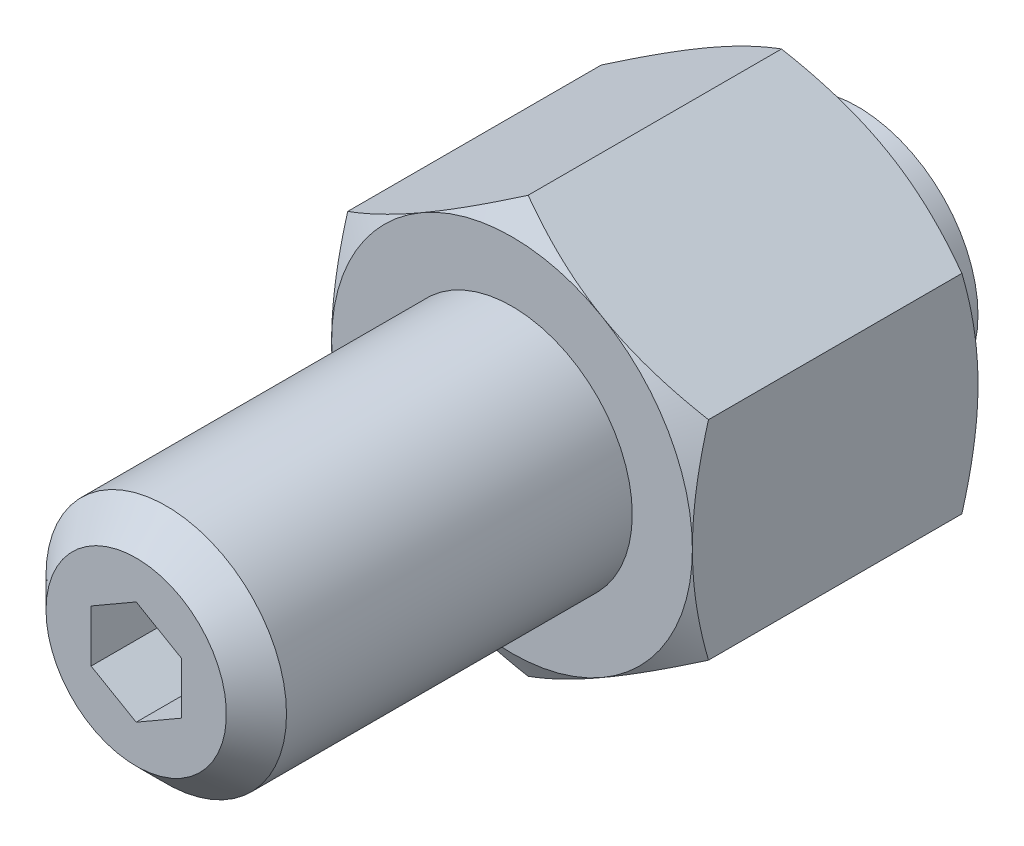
ISO-10303-21;
HEADER;
FILE_DESCRIPTION(('STEP AP214'),'2;1');
FILE_NAME('part.step','',(''),(''),'','','');
FILE_SCHEMA(('AUTOMOTIVE_DESIGN { 1 0 10303 214 1 1 1 1 }'));
ENDSEC;
DATA;
#1=APPLICATION_CONTEXT('core data for automotive mechanical design processes');
#2=APPLICATION_PROTOCOL_DEFINITION('international standard','automotive_design',2000,#1);
#3=PRODUCT_CONTEXT('',#1,'mechanical');
#4=PRODUCT('Part','Part','',(#3));
#5=PRODUCT_RELATED_PRODUCT_CATEGORY('part','',(#4));
#6=PRODUCT_DEFINITION_FORMATION('','',#4);
#7=PRODUCT_DEFINITION_CONTEXT('part definition',#1,'design');
#8=PRODUCT_DEFINITION('design','',#6,#7);
#9=PRODUCT_DEFINITION_SHAPE('','',#8);
#10=(LENGTH_UNIT() NAMED_UNIT(*) SI_UNIT(.MILLI.,.METRE.));
#11=(NAMED_UNIT(*) PLANE_ANGLE_UNIT() SI_UNIT($,.RADIAN.));
#12=(NAMED_UNIT(*) SI_UNIT($,.STERADIAN.) SOLID_ANGLE_UNIT());
#13=UNCERTAINTY_MEASURE_WITH_UNIT(LENGTH_MEASURE(1.E-05),#10,'distance_accuracy_value','');
#14=(GEOMETRIC_REPRESENTATION_CONTEXT(3) GLOBAL_UNCERTAINTY_ASSIGNED_CONTEXT((#13)) GLOBAL_UNIT_ASSIGNED_CONTEXT((#10,
#11,#12)) REPRESENTATION_CONTEXT('',''));
#15=CARTESIAN_POINT('',(0.,0.,0.));
#16=DIRECTION('',(0.,0.,1.));
#17=DIRECTION('',(1.,0.,0.));
#18=AXIS2_PLACEMENT_3D('',#15,#16,#17);
#19=CARTESIAN_POINT('',(0.,-13.8564064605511,28.));
#20=DIRECTION('',(-0.5,-0.866025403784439,0.));
#21=DIRECTION('',(-0.866025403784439,0.5,0.));
#22=AXIS2_PLACEMENT_3D('',#19,#20,#21);
#23=PLANE('',#22);
#24=DIRECTION('',(0.,0.,-1.));
#25=VECTOR('',#24,1.);
#26=CARTESIAN_POINT('',(-12.,-6.92820323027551,28.));
#27=LINE('',#26,#25);
#28=CARTESIAN_POINT('',(-12.,-6.92820323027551,21.9282032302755));
#29=VERTEX_POINT('',#28);
#30=CARTESIAN_POINT('',(-12.,-6.92820323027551,5.07179676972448));
#31=VERTEX_POINT('',#30);
#32=EDGE_CURVE('E170',#29,#31,#27,.T.);
#33=ORIENTED_EDGE('',*,*,#32,.T.);
#34=CARTESIAN_POINT('',(-12.0002,-6.92808776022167,5.07186343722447));
#35=CARTESIAN_POINT('',(-11.7364142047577,-7.08038456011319,4.98394963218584));
#36=CARTESIAN_POINT('',(-11.4716448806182,-7.23324920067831,4.90002599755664));
#37=CARTESIAN_POINT('',(-10.9399829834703,-7.54020434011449,4.74126621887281));
#38=CARTESIAN_POINT('',(-10.6730897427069,-7.69429522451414,4.66643306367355));
#39=CARTESIAN_POINT('',(-9.868109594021,-8.15905073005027,4.45701753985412));
#40=CARTESIAN_POINT('',(-9.32684492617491,-8.47155003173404,4.33790323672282));
#41=CARTESIAN_POINT('',(-8.51686717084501,-8.93919090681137,4.19823106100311));
#42=CARTESIAN_POINT('',(-8.25057389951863,-9.09293539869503,4.15844379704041));
#43=CARTESIAN_POINT('',(-7.71675440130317,-9.40113622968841,4.09172336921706));
#44=CARTESIAN_POINT('',(-7.44922815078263,-9.55559258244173,4.06479045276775));
#45=CARTESIAN_POINT('',(-6.91372963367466,-9.86476279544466,4.02446859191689));
#46=CARTESIAN_POINT('',(-6.64575827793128,-10.0194761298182,4.01106355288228));
#47=CARTESIAN_POINT('',(-6.10956726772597,-10.3290461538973,3.99808309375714));
#48=CARTESIAN_POINT('',(-5.84134762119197,-10.4839028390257,3.99850724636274));
#49=CARTESIAN_POINT('',(-5.3399106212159,-10.7734076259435,4.01222001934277));
#50=CARTESIAN_POINT('',(-5.10665750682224,-10.908076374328,4.02383598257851));
#51=CARTESIAN_POINT('',(-4.64068775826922,-11.1771041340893,4.05730800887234));
#52=CARTESIAN_POINT('',(-4.40797116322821,-11.3114631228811,4.07916479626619));
#53=CARTESIAN_POINT('',(-3.94320092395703,-11.5797983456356,4.13273741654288));
#54=CARTESIAN_POINT('',(-3.71114798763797,-11.7137741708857,4.1644613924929));
#55=CARTESIAN_POINT('',(-3.24813003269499,-11.9810977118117,4.23721177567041));
#56=CARTESIAN_POINT('',(-3.01716508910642,-12.1144453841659,4.27823881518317));
#57=CARTESIAN_POINT('',(-2.31605804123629,-12.5192297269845,4.41631165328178));
#58=CARTESIAN_POINT('',(-1.84794625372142,-12.789494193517,4.52712488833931));
#59=CARTESIAN_POINT('',(-0.918702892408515,-13.3259930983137,4.77862576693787));
#60=CARTESIAN_POINT('',(-0.457559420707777,-13.5922344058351,4.91925434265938));
#61=CARTESIAN_POINT('',(0.000200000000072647,-13.8565219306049,5.07186343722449));
#62=B_SPLINE_CURVE_WITH_KNOTS('',3,(#34,#35,#36,#37,#38,#39,#40,#41,#42,#43,#44,#45,#46,#47,#48,
#49,#50,#51,#52,#53,#54,#55,#56,#57,#58,#59,#60,#61),.UNSPECIFIED.,.F.,.F.,(4,2,2,2,2,2,2,2,2,2,
2,2,2,4),(0.,0.951004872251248,1.90232158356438,3.80900466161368,4.7389455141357,
5.66890426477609,6.59775529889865,7.5265776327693,8.3351464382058,9.14377244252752,
9.9530675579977,10.7624176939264,12.4167102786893,14.0677556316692),.UNSPECIFIED.);
#63=CARTESIAN_POINT('',(-6.,-10.3923048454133,4.));
#64=VERTEX_POINT('',#63);
#65=EDGE_CURVE('E149',#31,#64,#62,.T.);
#66=ORIENTED_EDGE('',*,*,#65,.T.);
#67=CARTESIAN_POINT('',(0.,-13.8564064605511,5.0717967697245));
#68=VERTEX_POINT('',#67);
#69=EDGE_CURVE('E160',#64,#68,#62,.T.);
#70=ORIENTED_EDGE('',*,*,#69,.T.);
#71=DIRECTION('',(0.,0.,-1.));
#72=VECTOR('',#71,1.);
#73=CARTESIAN_POINT('',(0.,-13.8564064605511,28.));
#74=LINE('',#73,#72);
#75=CARTESIAN_POINT('',(0.,-13.8564064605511,21.9282032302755));
#76=VERTEX_POINT('',#75);
#77=EDGE_CURVE('E349',#76,#68,#74,.T.);
#78=ORIENTED_EDGE('',*,*,#77,.F.);
#79=CARTESIAN_POINT('',(0.000200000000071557,-13.8565219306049,21.9281365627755));
#80=CARTESIAN_POINT('',(-0.26358579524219,-13.7042251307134,22.0160503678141));
#81=CARTESIAN_POINT('',(-0.528355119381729,-13.5513604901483,22.0999740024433));
#82=CARTESIAN_POINT('',(-1.06001701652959,-13.2444053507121,22.2587337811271));
#83=CARTESIAN_POINT('',(-1.326910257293,-13.0903144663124,22.3335669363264));
#84=CARTESIAN_POINT('',(-2.13189040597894,-12.6255589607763,22.5429824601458));
#85=CARTESIAN_POINT('',(-2.67315507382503,-12.3130596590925,22.6620967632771));
#86=CARTESIAN_POINT('',(-3.48313282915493,-11.8454187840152,22.8017689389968));
#87=CARTESIAN_POINT('',(-3.74942610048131,-11.6916742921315,22.8415562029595));
#88=CARTESIAN_POINT('',(-4.28324559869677,-11.3834734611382,22.9082766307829));
#89=CARTESIAN_POINT('',(-4.55077184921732,-11.2290171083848,22.9352095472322));
#90=CARTESIAN_POINT('',(-5.08627036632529,-10.9198468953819,22.9755314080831));
#91=CARTESIAN_POINT('',(-5.35424172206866,-10.7651335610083,22.9889364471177));
#92=CARTESIAN_POINT('',(-5.89043273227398,-10.4555635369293,23.0019169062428));
#93=CARTESIAN_POINT('',(-6.15865237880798,-10.3007068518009,23.0014927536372));
#94=CARTESIAN_POINT('',(-6.66008937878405,-10.0112020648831,22.9877799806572));
#95=CARTESIAN_POINT('',(-6.8933424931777,-9.87653331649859,22.9761640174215));
#96=CARTESIAN_POINT('',(-7.35931224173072,-9.60750555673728,22.9426919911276));
#97=CARTESIAN_POINT('',(-7.59202883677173,-9.47314656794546,22.9208352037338));
#98=CARTESIAN_POINT('',(-8.05679907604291,-9.20481134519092,22.8672625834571));
#99=CARTESIAN_POINT('',(-8.28885201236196,-9.07083551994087,22.8355386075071));
#100=CARTESIAN_POINT('',(-8.75186996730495,-8.80351197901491,22.7627882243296));
#101=CARTESIAN_POINT('',(-8.98283491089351,-8.67016430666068,22.7217611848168));
#102=CARTESIAN_POINT('',(-9.68394195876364,-8.26537996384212,22.5836883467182));
#103=CARTESIAN_POINT('',(-10.1520537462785,-7.99511549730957,22.4728751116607));
#104=CARTESIAN_POINT('',(-11.0812971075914,-7.4586165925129,22.2213742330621));
#105=CARTESIAN_POINT('',(-11.5424405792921,-7.19237528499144,22.0807456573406));
#106=CARTESIAN_POINT('',(-12.0002,-6.92808776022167,21.9281365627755));
#107=B_SPLINE_CURVE_WITH_KNOTS('',3,(#79,#80,#81,#82,#83,#84,#85,#86,#87,#88,#89,#90,#91,#92,
#93,#94,#95,#96,#97,#98,#99,#100,#101,#102,#103,#104,#105,#106),.UNSPECIFIED.,.F.,.F.,(4,2,2,2,
2,2,2,2,2,2,2,2,2,4),(0.,0.951004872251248,1.90232158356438,3.80900466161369,4.73894551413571,
5.6689042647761,6.59775529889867,7.52657763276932,8.33514643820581,9.14377244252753,
9.9530675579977,10.7624176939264,12.4167102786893,14.0677556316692),.UNSPECIFIED.);
#108=CARTESIAN_POINT('',(-6.,-10.3923048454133,23.));
#109=VERTEX_POINT('',#108);
#110=EDGE_CURVE('E347',#76,#109,#107,.T.);
#111=ORIENTED_EDGE('',*,*,#110,.T.);
#112=EDGE_CURVE('E235',#109,#29,#107,.T.);
#113=ORIENTED_EDGE('',*,*,#112,.T.);
#114=EDGE_LOOP('',(#33,#66,#70,#78,#111,#113));
#115=FACE_BOUND('',#114,.T.);
#116=ADVANCED_FACE('F14',(#115),#23,.T.);
#117=CARTESIAN_POINT('',(-12.,-6.92820323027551,28.));
#118=DIRECTION('',(-1.,0.,0.));
#119=DIRECTION('',(0.,1.,0.));
#120=AXIS2_PLACEMENT_3D('',#117,#118,#119);
#121=PLANE('',#120);
#122=DIRECTION('',(0.,0.,-1.));
#123=VECTOR('',#122,1.);
#124=CARTESIAN_POINT('',(-12.,6.92820323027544,28.));
#125=LINE('',#124,#123);
#126=CARTESIAN_POINT('',(-12.,6.92820323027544,21.9282032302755));
#127=VERTEX_POINT('',#126);
#128=CARTESIAN_POINT('',(-12.,6.92820323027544,5.07179676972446));
#129=VERTEX_POINT('',#128);
#130=EDGE_CURVE('E306',#127,#129,#125,.T.);
#131=ORIENTED_EDGE('',*,*,#130,.T.);
#132=CARTESIAN_POINT('',(-12.,-18.514505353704,9.81001889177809));
#133=CARTESIAN_POINT('',(-12.,-18.2528554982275,9.68325551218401));
#134=CARTESIAN_POINT('',(-12.,-17.9908960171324,9.55713153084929));
#135=CARTESIAN_POINT('',(-12.,-17.4662931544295,9.30630736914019));
#136=CARTESIAN_POINT('',(-12.,-17.2036497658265,9.1816072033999));
#137=CARTESIAN_POINT('',(-12.,-16.4145254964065,8.80982645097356));
#138=CARTESIAN_POINT('',(-12.,-15.8869293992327,8.56510393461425));
#139=CARTESIAN_POINT('',(-12.,-14.8252571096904,8.08210706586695));
#140=CARTESIAN_POINT('',(-12.,-14.2911612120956,7.84387592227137));
#141=CARTESIAN_POINT('',(-12.,-13.2186884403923,7.37728727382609));
#142=CARTESIAN_POINT('',(-12.,-12.6803117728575,7.1489292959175));
#143=CARTESIAN_POINT('',(-12.,-11.5814012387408,6.69771449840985));
#144=CARTESIAN_POINT('',(-12.,-11.0207028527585,6.47525624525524));
#145=CARTESIAN_POINT('',(-12.,-9.89270702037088,6.04740793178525));
#146=CARTESIAN_POINT('',(-12.,-9.32540883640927,5.84201980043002));
#147=CARTESIAN_POINT('',(-12.,-8.18442279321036,5.45377673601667));
#148=CARTESIAN_POINT('',(-12.,-7.61075087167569,5.27087534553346));
#149=CARTESIAN_POINT('',(-12.,-6.45512408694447,4.93352803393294));
#150=CARTESIAN_POINT('',(-12.,-5.87317192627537,4.77907304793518));
#151=CARTESIAN_POINT('',(-12.,-4.99554772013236,4.57478286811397));
#152=CARTESIAN_POINT('',(-12.,-4.70301292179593,4.51138495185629));
#153=CARTESIAN_POINT('',(-12.,-4.11596261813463,4.39448403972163));
#154=CARTESIAN_POINT('',(-12.,-3.82144715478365,4.3409808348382));
#155=CARTESIAN_POINT('',(-12.,-3.23064499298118,4.24481940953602));
#156=CARTESIAN_POINT('',(-12.,-2.93435831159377,4.20216108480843));
#157=CARTESIAN_POINT('',(-12.,-2.34033616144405,4.12854399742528));
#158=CARTESIAN_POINT('',(-12.,-2.04260074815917,4.09758479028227));
#159=CARTESIAN_POINT('',(-12.,-1.44994185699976,4.04836377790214));
#160=CARTESIAN_POINT('',(-12.,-1.15503163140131,4.02994337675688));
#161=CARTESIAN_POINT('',(-12.,-0.564697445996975,4.00558389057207));
#162=CARTESIAN_POINT('',(-12.,-0.269273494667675,3.99964460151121));
#163=CARTESIAN_POINT('',(-12.,0.32156198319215,4.00038828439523));
#164=CARTESIAN_POINT('',(-12.,0.616973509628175,4.00707133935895));
#165=CARTESIAN_POINT('',(-12.,1.20725495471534,4.03289834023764));
#166=CARTESIAN_POINT('',(-12.,1.50212484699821,4.05204287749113));
#167=CARTESIAN_POINT('',(-12.,2.21372246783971,4.11287795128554));
#168=CARTESIAN_POINT('',(-12.,2.62993972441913,4.1606438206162));
#169=CARTESIAN_POINT('',(-12.,3.45922421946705,4.27837926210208));
#170=CARTESIAN_POINT('',(-12.,3.87229100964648,4.34835193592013));
#171=CARTESIAN_POINT('',(-12.,4.69490229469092,4.50801157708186));
#172=CARTESIAN_POINT('',(-12.,5.10444371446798,4.59771423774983));
#173=CARTESIAN_POINT('',(-12.,5.91938859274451,4.7941019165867));
#174=CARTESIAN_POINT('',(-12.,6.32479212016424,4.90078665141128));
#175=CARTESIAN_POINT('',(-12.,7.14028712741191,5.13104466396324));
#176=CARTESIAN_POINT('',(-12.,7.55028842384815,5.25493514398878));
#177=CARTESIAN_POINT('',(-12.,8.36625124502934,5.5153060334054));
#178=CARTESIAN_POINT('',(-12.,8.77221274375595,5.65178652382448));
#179=CARTESIAN_POINT('',(-12.,9.58029997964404,5.93518898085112));
#180=CARTESIAN_POINT('',(-12.,9.98242699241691,6.08210732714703));
#181=CARTESIAN_POINT('',(-12.,10.7833633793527,6.38467779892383));
#182=CARTESIAN_POINT('',(-12.,11.1821727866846,6.54032983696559));
#183=CARTESIAN_POINT('',(-12.,12.0992103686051,6.90796928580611));
#184=CARTESIAN_POINT('',(-12.,12.6163987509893,7.12254593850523));
#185=CARTESIAN_POINT('',(-12.,13.6465661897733,7.56160364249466));
#186=CARTESIAN_POINT('',(-12.,14.1595450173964,7.78608522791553));
#187=CARTESIAN_POINT('',(-12.,15.1820453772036,8.243035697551));
#188=CARTESIAN_POINT('',(-12.,15.6915662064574,8.47550615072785));
#189=CARTESIAN_POINT('',(-12.,16.7076057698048,8.94687848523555));
#190=CARTESIAN_POINT('',(-12.,17.2141245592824,9.18578024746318));
#191=CARTESIAN_POINT('',(-12.,18.225146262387,9.6690922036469));
#192=CARTESIAN_POINT('',(-12.,18.729646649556,9.91350767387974));
#193=CARTESIAN_POINT('',(-12.,19.7365108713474,10.4066993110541));
#194=CARTESIAN_POINT('',(-12.,20.2388746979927,10.6554754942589));
#195=CARTESIAN_POINT('',(-12.,21.2417268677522,11.1566338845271));
#196=CARTESIAN_POINT('',(-12.,21.7422154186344,11.4090156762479));
#197=CARTESIAN_POINT('',(-12.,22.7416382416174,11.9168398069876));
#198=CARTESIAN_POINT('',(-12.,23.2405725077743,12.1722821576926));
#199=CARTESIAN_POINT('',(-12.,24.6557313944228,12.9014463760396));
#200=CARTESIAN_POINT('',(-12.,25.5703677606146,13.3782507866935));
#201=CARTESIAN_POINT('',(-12.,27.3962090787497,14.3384384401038));
#202=CARTESIAN_POINT('',(-12.,28.3074139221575,14.8218218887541));
#203=CARTESIAN_POINT('',(-12.,30.1250162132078,15.7925311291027));
#204=CARTESIAN_POINT('',(-12.,31.0314199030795,16.2798452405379));
#205=CARTESIAN_POINT('',(-12.,32.389394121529,17.013776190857));
#206=CARTESIAN_POINT('',(-12.,32.8417690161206,17.2589069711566));
#207=CARTESIAN_POINT('',(-12.,33.7460350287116,17.7500575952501));
#208=CARTESIAN_POINT('',(-12.,34.1979261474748,17.9960774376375));
#209=CARTESIAN_POINT('',(-12.,34.649602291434,18.2424914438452));
#210=B_SPLINE_CURVE_WITH_KNOTS('',3,(#132,#133,#134,#135,#136,#137,#138,#139,#140,#141,#142,
#143,#144,#145,#146,#147,#148,#149,#150,#151,#152,#153,#154,#155,#156,#157,#158,#159,#160,#161,
#162,#163,#164,#165,#166,#167,#168,#169,#170,#171,#172,#173,#174,#175,#176,#177,#178,#179,#180,
#181,#182,#183,#184,#185,#186,#187,#188,#189,#190,#191,#192,#193,#194,#195,#196,#197,#198,#199,
#200,#201,#202,#203,#204,#205,#206,#207,#208,#209),.UNSPECIFIED.,.F.,.F.,(4,2,2,2,2,2,2,2,2,2,2,
2,2,2,2,2,2,2,2,2,2,2,2,2,2,2,2,2,2,2,2,2,2,2,2,2,2,2,4),(0.,0.87221763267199,1.74444422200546,
3.48916049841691,5.24353774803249,6.99783084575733,8.80726868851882,10.6169107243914,
12.4227488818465,14.2280105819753,15.1258475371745,16.0236655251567,16.9214748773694,
17.819250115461,18.705447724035,19.5916308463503,20.4778197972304,21.3640508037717,
22.6202009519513,23.8765266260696,25.1338552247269,26.3911628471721,27.6758523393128,
28.9605501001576,30.2448044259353,31.5290458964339,33.2087128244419,34.8884704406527,
36.5685598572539,38.2486181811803,39.9303588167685,41.6121057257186,43.2936604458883,
44.9752215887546,48.0695502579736,51.1639759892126,54.2512565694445,55.7948196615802,
57.3383803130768),.UNSPECIFIED.);
#211=CARTESIAN_POINT('',(-12.,0.,4.));
#212=VERTEX_POINT('',#211);
#213=EDGE_CURVE('E289',#129,#212,#210,.F.);
#214=ORIENTED_EDGE('',*,*,#213,.T.);
#215=EDGE_CURVE('E151',#212,#31,#210,.F.);
#216=ORIENTED_EDGE('',*,*,#215,.T.);
#217=ORIENTED_EDGE('',*,*,#32,.F.);
#218=CARTESIAN_POINT('',(-12.,-18.514505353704,17.1899811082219));
#219=CARTESIAN_POINT('',(-12.,-18.2528554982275,17.316744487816));
#220=CARTESIAN_POINT('',(-12.,-17.9908960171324,17.4428684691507));
#221=CARTESIAN_POINT('',(-12.,-17.4662931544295,17.6936926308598));
#222=CARTESIAN_POINT('',(-12.,-17.2036497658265,17.8183927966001));
#223=CARTESIAN_POINT('',(-12.,-16.4145254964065,18.1901735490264));
#224=CARTESIAN_POINT('',(-12.,-15.8869293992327,18.4348960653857));
#225=CARTESIAN_POINT('',(-12.,-14.8252571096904,18.917892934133));
#226=CARTESIAN_POINT('',(-12.,-14.2911612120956,19.1561240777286));
#227=CARTESIAN_POINT('',(-12.,-13.2186884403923,19.6227127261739));
#228=CARTESIAN_POINT('',(-12.,-12.6803117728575,19.8510707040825));
#229=CARTESIAN_POINT('',(-12.,-11.5814012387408,20.3022855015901));
#230=CARTESIAN_POINT('',(-12.,-11.0207028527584,20.5247437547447));
#231=CARTESIAN_POINT('',(-12.,-9.89270702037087,20.9525920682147));
#232=CARTESIAN_POINT('',(-12.,-9.32540883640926,21.15798019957));
#233=CARTESIAN_POINT('',(-12.,-8.18442279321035,21.5462232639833));
#234=CARTESIAN_POINT('',(-12.,-7.61075087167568,21.7291246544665));
#235=CARTESIAN_POINT('',(-12.,-6.45512408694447,22.066471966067));
#236=CARTESIAN_POINT('',(-12.,-5.87317192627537,22.2209269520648));
#237=CARTESIAN_POINT('',(-12.,-4.99554772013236,22.425217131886));
#238=CARTESIAN_POINT('',(-12.,-4.70301292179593,22.4886150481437));
#239=CARTESIAN_POINT('',(-12.,-4.11596261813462,22.6055159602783));
#240=CARTESIAN_POINT('',(-12.,-3.82144715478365,22.6590191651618));
#241=CARTESIAN_POINT('',(-12.,-3.23064499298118,22.7551805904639));
#242=CARTESIAN_POINT('',(-12.,-2.93435831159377,22.7978389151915));
#243=CARTESIAN_POINT('',(-12.,-2.34033616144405,22.8714560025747));
#244=CARTESIAN_POINT('',(-12.,-2.04260074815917,22.9024152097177));
#245=CARTESIAN_POINT('',(-12.,-1.44994185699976,22.9516362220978));
#246=CARTESIAN_POINT('',(-12.,-1.15503163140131,22.9700566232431));
#247=CARTESIAN_POINT('',(-12.,-0.564697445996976,22.9944161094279));
#248=CARTESIAN_POINT('',(-12.,-0.269273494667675,23.0003553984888));
#249=CARTESIAN_POINT('',(-12.,0.32156198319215,22.9996117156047));
#250=CARTESIAN_POINT('',(-12.,0.616973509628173,22.992928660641));
#251=CARTESIAN_POINT('',(-12.,1.20725495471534,22.9671016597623));
#252=CARTESIAN_POINT('',(-12.,1.50212484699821,22.9479571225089));
#253=CARTESIAN_POINT('',(-12.,2.21372246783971,22.8871220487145));
#254=CARTESIAN_POINT('',(-12.,2.62993972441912,22.8393561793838));
#255=CARTESIAN_POINT('',(-12.,3.45922421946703,22.7216207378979));
#256=CARTESIAN_POINT('',(-12.,3.87229100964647,22.6516480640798));
#257=CARTESIAN_POINT('',(-12.,4.69490229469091,22.4919884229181));
#258=CARTESIAN_POINT('',(-12.,5.10444371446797,22.4022857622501));
#259=CARTESIAN_POINT('',(-12.,5.9193885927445,22.2058980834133));
#260=CARTESIAN_POINT('',(-12.,6.32479212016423,22.0992133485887));
#261=CARTESIAN_POINT('',(-12.,7.1402871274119,21.8689553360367));
#262=CARTESIAN_POINT('',(-12.,7.55028842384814,21.7450648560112));
#263=CARTESIAN_POINT('',(-12.,8.36625124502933,21.4846939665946));
#264=CARTESIAN_POINT('',(-12.,8.77221274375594,21.3482134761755));
#265=CARTESIAN_POINT('',(-12.,9.58029997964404,21.0648110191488));
#266=CARTESIAN_POINT('',(-12.,9.9824269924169,20.9178926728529));
#267=CARTESIAN_POINT('',(-12.,10.7833633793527,20.6153222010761));
#268=CARTESIAN_POINT('',(-12.,11.1821727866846,20.4596701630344));
#269=CARTESIAN_POINT('',(-12.,12.0992103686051,20.0920307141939));
#270=CARTESIAN_POINT('',(-12.,12.6163987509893,19.8774540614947));
#271=CARTESIAN_POINT('',(-12.,13.6465661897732,19.4383963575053));
#272=CARTESIAN_POINT('',(-12.,14.1595450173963,19.2139147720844));
#273=CARTESIAN_POINT('',(-12.,15.1820453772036,18.756964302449));
#274=CARTESIAN_POINT('',(-12.,15.6915662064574,18.5244938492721));
#275=CARTESIAN_POINT('',(-12.,16.7076057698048,18.0531215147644));
#276=CARTESIAN_POINT('',(-12.,17.2141245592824,17.8142197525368));
#277=CARTESIAN_POINT('',(-12.,18.225146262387,17.3309077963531));
#278=CARTESIAN_POINT('',(-12.,18.729646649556,17.0864923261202));
#279=CARTESIAN_POINT('',(-12.,19.7365108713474,16.5933006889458));
#280=CARTESIAN_POINT('',(-12.,20.2388746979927,16.3445245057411));
#281=CARTESIAN_POINT('',(-12.,21.2417268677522,15.8433661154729));
#282=CARTESIAN_POINT('',(-12.,21.7422154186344,15.5909843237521));
#283=CARTESIAN_POINT('',(-12.,22.7416382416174,15.0831601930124));
#284=CARTESIAN_POINT('',(-12.,23.2405725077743,14.8277178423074));
#285=CARTESIAN_POINT('',(-12.,24.6557313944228,14.0985536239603));
#286=CARTESIAN_POINT('',(-12.,25.5703677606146,13.6217492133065));
#287=CARTESIAN_POINT('',(-12.,27.3962090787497,12.6615615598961));
#288=CARTESIAN_POINT('',(-12.,28.3074139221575,12.1781781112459));
#289=CARTESIAN_POINT('',(-12.,30.1250162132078,11.2074688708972));
#290=CARTESIAN_POINT('',(-12.,31.0314199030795,10.720154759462));
#291=CARTESIAN_POINT('',(-12.,32.389394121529,9.98622380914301));
#292=CARTESIAN_POINT('',(-12.,32.8417690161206,9.74109302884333));
#293=CARTESIAN_POINT('',(-12.,33.7460350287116,9.24994240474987));
#294=CARTESIAN_POINT('',(-12.,34.1979261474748,9.00392256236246));
#295=CARTESIAN_POINT('',(-12.,34.649602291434,8.75750855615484));
#296=B_SPLINE_CURVE_WITH_KNOTS('',3,(#218,#219,#220,#221,#222,#223,#224,#225,#226,#227,#228,
#229,#230,#231,#232,#233,#234,#235,#236,#237,#238,#239,#240,#241,#242,#243,#244,#245,#246,#247,
#248,#249,#250,#251,#252,#253,#254,#255,#256,#257,#258,#259,#260,#261,#262,#263,#264,#265,#266,
#267,#268,#269,#270,#271,#272,#273,#274,#275,#276,#277,#278,#279,#280,#281,#282,#283,#284,#285,
#286,#287,#288,#289,#290,#291,#292,#293,#294,#295),.UNSPECIFIED.,.F.,.F.,(4,2,2,2,2,2,2,2,2,2,2,
2,2,2,2,2,2,2,2,2,2,2,2,2,2,2,2,2,2,2,2,2,2,2,2,2,2,2,4),(0.,0.872217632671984,1.74444422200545,
3.4891604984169,5.24353774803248,6.99783084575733,8.80726868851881,10.6169107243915,
12.4227488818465,14.2280105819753,15.1258475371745,16.0236655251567,16.9214748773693,
17.819250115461,18.705447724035,19.5916308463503,20.4778197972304,21.3640508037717,
22.6202009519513,23.8765266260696,25.1338552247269,26.3911628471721,27.6758523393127,
28.9605501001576,30.2448044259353,31.5290458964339,33.2087128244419,34.8884704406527,
36.5685598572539,38.2486181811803,39.9303588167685,41.6121057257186,43.2936604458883,
44.9752215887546,48.0695502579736,51.1639759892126,54.2512565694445,55.7948196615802,
57.3383803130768),.UNSPECIFIED.);
#297=CARTESIAN_POINT('',(-12.,0.,23.));
#298=VERTEX_POINT('',#297);
#299=EDGE_CURVE('E245',#29,#298,#296,.T.);
#300=ORIENTED_EDGE('',*,*,#299,.T.);
#301=EDGE_CURVE('E265',#298,#127,#296,.T.);
#302=ORIENTED_EDGE('',*,*,#301,.T.);
#303=EDGE_LOOP('',(#131,#214,#216,#217,#300,#302));
#304=FACE_BOUND('',#303,.T.);
#305=ADVANCED_FACE('F269',(#304),#121,.T.);
#306=CARTESIAN_POINT('',(0.,13.8564064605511,28.));
#307=DIRECTION('',(0.500000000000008,-0.866025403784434,0.));
#308=DIRECTION('',(-0.866025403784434,-0.500000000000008,0.));
#309=AXIS2_PLACEMENT_3D('',#306,#307,#308);
#310=PLANE('',#309);
#311=CARTESIAN_POINT('',(-12.0002,6.9280877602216,5.07186343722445));
#312=CARTESIAN_POINT('',(-11.7364142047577,7.08038456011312,4.98394963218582));
#313=CARTESIAN_POINT('',(-11.4716448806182,7.23324920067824,4.90002599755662));
#314=CARTESIAN_POINT('',(-10.9399829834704,7.54020434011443,4.74126621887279));
#315=CARTESIAN_POINT('',(-10.6730897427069,7.69429522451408,4.66643306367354));
#316=CARTESIAN_POINT('',(-9.86810959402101,8.15905073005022,4.45701753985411));
#317=CARTESIAN_POINT('',(-9.32684492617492,8.471550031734,4.33790323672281));
#318=CARTESIAN_POINT('',(-8.51686717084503,8.93919090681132,4.1982310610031));
#319=CARTESIAN_POINT('',(-8.25057389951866,9.092935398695,4.15844379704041));
#320=CARTESIAN_POINT('',(-7.7167544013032,9.40113622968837,4.09172336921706));
#321=CARTESIAN_POINT('',(-7.44922815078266,9.5555925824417,4.06479045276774));
#322=CARTESIAN_POINT('',(-6.91372963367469,9.86476279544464,4.02446859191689));
#323=CARTESIAN_POINT('',(-6.64575827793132,10.0194761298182,4.01106355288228));
#324=CARTESIAN_POINT('',(-6.10956726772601,10.3290461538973,3.99808309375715));
#325=CARTESIAN_POINT('',(-5.84134762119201,10.4839028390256,3.99850724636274));
#326=CARTESIAN_POINT('',(-5.33991062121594,10.7734076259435,4.01222001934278));
#327=CARTESIAN_POINT('',(-5.10665750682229,10.908076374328,4.02383598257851));
#328=CARTESIAN_POINT('',(-4.64068775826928,11.1771041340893,4.05730800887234));
#329=CARTESIAN_POINT('',(-4.40797116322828,11.3114631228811,4.07916479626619));
#330=CARTESIAN_POINT('',(-3.9432009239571,11.5797983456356,4.13273741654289));
#331=CARTESIAN_POINT('',(-3.71114798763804,11.7137741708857,4.1644613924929));
#332=CARTESIAN_POINT('',(-3.24813003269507,11.9810977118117,4.23721177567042));
#333=CARTESIAN_POINT('',(-3.01716508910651,12.1144453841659,4.27823881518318));
#334=CARTESIAN_POINT('',(-2.31605804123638,12.5192297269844,4.41631165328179));
#335=CARTESIAN_POINT('',(-1.84794625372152,12.789494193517,4.52712488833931));
#336=CARTESIAN_POINT('',(-0.918702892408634,13.3259930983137,4.77862576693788));
#337=CARTESIAN_POINT('',(-0.457559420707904,13.5922344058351,4.91925434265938));
#338=CARTESIAN_POINT('',(0.000199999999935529,13.8565219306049,5.07186343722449));
#339=B_SPLINE_CURVE_WITH_KNOTS('',3,(#311,#312,#313,#314,#315,#316,#317,#318,#319,#320,#321,
#322,#323,#324,#325,#326,#327,#328,#329,#330,#331,#332,#333,#334,#335,#336,#337,#338),
.UNSPECIFIED.,.F.,.F.,(4,2,2,2,2,2,2,2,2,2,2,2,2,4),(0.,0.951004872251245,1.90232158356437,
3.80900466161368,4.73894551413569,5.66890426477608,6.59775529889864,7.52657763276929,
8.33514643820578,9.14377244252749,9.95306755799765,10.7624176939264,12.4167102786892,
14.0677556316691),.UNSPECIFIED.);
#340=CARTESIAN_POINT('',(-6.0000000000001,10.3923048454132,4.));
#341=VERTEX_POINT('',#340);
#342=EDGE_CURVE('E280',#129,#341,#339,.T.);
#343=ORIENTED_EDGE('',*,*,#342,.F.);
#344=ORIENTED_EDGE('',*,*,#130,.F.);
#345=CARTESIAN_POINT('',(0.000199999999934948,13.8565219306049,21.9281365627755));
#346=CARTESIAN_POINT('',(-0.263585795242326,13.7042251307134,22.0160503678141));
#347=CARTESIAN_POINT('',(-0.528355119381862,13.5513604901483,22.0999740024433));
#348=CARTESIAN_POINT('',(-1.06001701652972,13.2444053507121,22.2587337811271));
#349=CARTESIAN_POINT('',(-1.32691025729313,13.0903144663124,22.3335669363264));
#350=CARTESIAN_POINT('',(-2.13189040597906,12.6255589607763,22.5429824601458));
#351=CARTESIAN_POINT('',(-2.67315507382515,12.3130596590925,22.6620967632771));
#352=CARTESIAN_POINT('',(-3.48313282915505,11.8454187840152,22.8017689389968));
#353=CARTESIAN_POINT('',(-3.74942610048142,11.6916742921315,22.8415562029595));
#354=CARTESIAN_POINT('',(-4.28324559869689,11.3834734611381,22.9082766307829));
#355=CARTESIAN_POINT('',(-4.55077184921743,11.2290171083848,22.9352095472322));
#356=CARTESIAN_POINT('',(-5.0862703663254,10.9198468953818,22.9755314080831));
#357=CARTESIAN_POINT('',(-5.35424172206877,10.7651335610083,22.9889364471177));
#358=CARTESIAN_POINT('',(-5.89043273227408,10.4555635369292,23.0019169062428));
#359=CARTESIAN_POINT('',(-6.15865237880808,10.3007068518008,23.0014927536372));
#360=CARTESIAN_POINT('',(-6.66008937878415,10.011202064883,22.9877799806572));
#361=CARTESIAN_POINT('',(-6.8933424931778,9.87653331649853,22.9761640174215));
#362=CARTESIAN_POINT('',(-7.35931224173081,9.60750555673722,22.9426919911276));
#363=CARTESIAN_POINT('',(-7.59202883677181,9.4731465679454,22.9208352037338));
#364=CARTESIAN_POINT('',(-8.05679907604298,9.20481134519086,22.8672625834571));
#365=CARTESIAN_POINT('',(-8.28885201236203,9.0708355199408,22.8355386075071));
#366=CARTESIAN_POINT('',(-8.75186996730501,8.80351197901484,22.7627882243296));
#367=CARTESIAN_POINT('',(-8.98283491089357,8.67016430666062,22.7217611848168));
#368=CARTESIAN_POINT('',(-9.68394195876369,8.26537996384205,22.5836883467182));
#369=CARTESIAN_POINT('',(-10.1520537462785,7.9951154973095,22.4728751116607));
#370=CARTESIAN_POINT('',(-11.0812971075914,7.45861659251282,22.2213742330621));
#371=CARTESIAN_POINT('',(-11.5424405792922,7.19237528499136,22.0807456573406));
#372=CARTESIAN_POINT('',(-12.0002,6.9280877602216,21.9281365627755));
#373=B_SPLINE_CURVE_WITH_KNOTS('',3,(#345,#346,#347,#348,#349,#350,#351,#352,#353,#354,#355,
#356,#357,#358,#359,#360,#361,#362,#363,#364,#365,#366,#367,#368,#369,#370,#371,#372),
.UNSPECIFIED.,.F.,.F.,(4,2,2,2,2,2,2,2,2,2,2,2,2,4),(0.,0.951004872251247,1.90232158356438,
3.80900466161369,4.73894551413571,5.6689042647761,6.59775529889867,7.52657763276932,
8.3351464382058,9.14377244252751,9.95306755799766,10.7624176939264,12.4167102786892,
14.0677556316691),.UNSPECIFIED.);
#374=CARTESIAN_POINT('',(-6.0000000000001,10.3923048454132,23.));
#375=VERTEX_POINT('',#374);
#376=EDGE_CURVE('E259',#375,#127,#373,.T.);
#377=ORIENTED_EDGE('',*,*,#376,.F.);
#378=CARTESIAN_POINT('',(0.,13.8564064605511,21.9282032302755));
#379=VERTEX_POINT('',#378);
#380=EDGE_CURVE('E264',#379,#375,#373,.T.);
#381=ORIENTED_EDGE('',*,*,#380,.F.);
#382=DIRECTION('',(0.,0.,-1.));
#383=VECTOR('',#382,1.);
#384=CARTESIAN_POINT('',(0.,13.8564064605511,28.));
#385=LINE('',#384,#383);
#386=CARTESIAN_POINT('',(0.,13.8564064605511,5.0717967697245));
#387=VERTEX_POINT('',#386);
#388=EDGE_CURVE('E314',#379,#387,#385,.T.);
#389=ORIENTED_EDGE('',*,*,#388,.T.);
#390=EDGE_CURVE('E274',#341,#387,#339,.T.);
#391=ORIENTED_EDGE('',*,*,#390,.F.);
#392=EDGE_LOOP('',(#343,#344,#377,#381,#389,#391));
#393=FACE_BOUND('',#392,.T.);
#394=ADVANCED_FACE('F266',(#393),#310,.F.);
#395=CARTESIAN_POINT('',(0.,13.8564064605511,28.));
#396=DIRECTION('',(0.5,0.866025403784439,0.));
#397=DIRECTION('',(0.866025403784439,-0.5,0.));
#398=AXIS2_PLACEMENT_3D('',#395,#396,#397);
#399=PLANE('',#398);
#400=DIRECTION('',(0.,0.,-1.));
#401=VECTOR('',#400,1.);
#402=CARTESIAN_POINT('',(12.,6.92820323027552,28.));
#403=LINE('',#402,#401);
#404=CARTESIAN_POINT('',(12.,6.92820323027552,21.9282032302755));
#405=VERTEX_POINT('',#404);
#406=CARTESIAN_POINT('',(12.,6.92820323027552,5.07179676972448));
#407=VERTEX_POINT('',#406);
#408=EDGE_CURVE('E326',#405,#407,#403,.T.);
#409=ORIENTED_EDGE('',*,*,#408,.T.);
#410=CARTESIAN_POINT('',(12.0002,6.92808776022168,5.07186343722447));
#411=CARTESIAN_POINT('',(11.7364142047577,7.0803845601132,4.98394963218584));
#412=CARTESIAN_POINT('',(11.4716448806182,7.23324920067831,4.90002599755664));
#413=CARTESIAN_POINT('',(10.9399829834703,7.5402043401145,4.74126621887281));
#414=CARTESIAN_POINT('',(10.6730897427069,7.69429522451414,4.66643306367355));
#415=CARTESIAN_POINT('',(9.86810959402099,8.15905073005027,4.45701753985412));
#416=CARTESIAN_POINT('',(9.32684492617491,8.47155003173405,4.33790323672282));
#417=CARTESIAN_POINT('',(8.51686717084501,8.93919090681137,4.19823106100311));
#418=CARTESIAN_POINT('',(8.25057389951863,9.09293539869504,4.15844379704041));
#419=CARTESIAN_POINT('',(7.71675440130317,9.40113622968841,4.09172336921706));
#420=CARTESIAN_POINT('',(7.44922815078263,9.55559258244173,4.06479045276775));
#421=CARTESIAN_POINT('',(6.91372963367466,9.86476279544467,4.02446859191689));
#422=CARTESIAN_POINT('',(6.64575827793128,10.0194761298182,4.01106355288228));
#423=CARTESIAN_POINT('',(6.10956726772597,10.3290461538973,3.99808309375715));
#424=CARTESIAN_POINT('',(5.84134762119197,10.4839028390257,3.99850724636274));
#425=CARTESIAN_POINT('',(5.3399106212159,10.7734076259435,4.01222001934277));
#426=CARTESIAN_POINT('',(5.10665750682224,10.908076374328,4.02383598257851));
#427=CARTESIAN_POINT('',(4.64068775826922,11.1771041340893,4.05730800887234));
#428=CARTESIAN_POINT('',(4.40797116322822,11.3114631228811,4.07916479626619));
#429=CARTESIAN_POINT('',(3.94320092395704,11.5797983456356,4.13273741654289));
#430=CARTESIAN_POINT('',(3.71114798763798,11.7137741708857,4.1644613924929));
#431=CARTESIAN_POINT('',(3.24813003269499,11.9810977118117,4.23721177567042));
#432=CARTESIAN_POINT('',(3.01716508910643,12.1144453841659,4.27823881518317));
#433=CARTESIAN_POINT('',(2.31605804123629,12.5192297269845,4.41631165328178));
#434=CARTESIAN_POINT('',(1.84794625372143,12.789494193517,4.52712488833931));
#435=CARTESIAN_POINT('',(0.91870289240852,13.3259930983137,4.77862576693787));
#436=CARTESIAN_POINT('',(0.457559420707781,13.5922344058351,4.91925434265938));
#437=CARTESIAN_POINT('',(-0.000200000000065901,13.8565219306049,5.07186343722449));
#438=B_SPLINE_CURVE_WITH_KNOTS('',3,(#410,#411,#412,#413,#414,#415,#416,#417,#418,#419,#420,
#421,#422,#423,#424,#425,#426,#427,#428,#429,#430,#431,#432,#433,#434,#435,#436,#437),
.UNSPECIFIED.,.F.,.F.,(4,2,2,2,2,2,2,2,2,2,2,2,2,4),(0.,0.951004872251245,1.90232158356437,
3.80900466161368,4.7389455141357,5.66890426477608,6.59775529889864,7.5265776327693,
8.33514643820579,9.14377244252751,9.95306755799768,10.7624176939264,12.4167102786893,
14.0677556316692),.UNSPECIFIED.);
#439=CARTESIAN_POINT('',(6.,10.3923048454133,4.));
#440=VERTEX_POINT('',#439);
#441=EDGE_CURVE('E165',#407,#440,#438,.T.);
#442=ORIENTED_EDGE('',*,*,#441,.T.);
#443=EDGE_CURVE('E171',#440,#387,#438,.T.);
#444=ORIENTED_EDGE('',*,*,#443,.T.);
#445=ORIENTED_EDGE('',*,*,#388,.F.);
#446=CARTESIAN_POINT('',(-0.000200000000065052,13.8565219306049,21.9281365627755));
#447=CARTESIAN_POINT('',(0.263585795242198,13.7042251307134,22.0160503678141));
#448=CARTESIAN_POINT('',(0.528355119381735,13.5513604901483,22.0999740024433));
#449=CARTESIAN_POINT('',(1.0600170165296,13.2444053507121,22.2587337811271));
#450=CARTESIAN_POINT('',(1.32691025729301,13.0903144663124,22.3335669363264));
#451=CARTESIAN_POINT('',(2.13189040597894,12.6255589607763,22.5429824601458));
#452=CARTESIAN_POINT('',(2.67315507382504,12.3130596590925,22.6620967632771));
#453=CARTESIAN_POINT('',(3.48313282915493,11.8454187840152,22.8017689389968));
#454=CARTESIAN_POINT('',(3.74942610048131,11.6916742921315,22.8415562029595));
#455=CARTESIAN_POINT('',(4.28324559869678,11.3834734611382,22.9082766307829));
#456=CARTESIAN_POINT('',(4.55077184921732,11.2290171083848,22.9352095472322));
#457=CARTESIAN_POINT('',(5.08627036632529,10.9198468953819,22.9755314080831));
#458=CARTESIAN_POINT('',(5.35424172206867,10.7651335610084,22.9889364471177));
#459=CARTESIAN_POINT('',(5.89043273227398,10.4555635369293,23.0019169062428));
#460=CARTESIAN_POINT('',(6.15865237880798,10.3007068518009,23.0014927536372));
#461=CARTESIAN_POINT('',(6.66008937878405,10.0112020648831,22.9877799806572));
#462=CARTESIAN_POINT('',(6.8933424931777,9.87653331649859,22.9761640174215));
#463=CARTESIAN_POINT('',(7.35931224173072,9.60750555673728,22.9426919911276));
#464=CARTESIAN_POINT('',(7.59202883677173,9.47314656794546,22.9208352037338));
#465=CARTESIAN_POINT('',(8.05679907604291,9.20481134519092,22.8672625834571));
#466=CARTESIAN_POINT('',(8.28885201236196,9.07083551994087,22.8355386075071));
#467=CARTESIAN_POINT('',(8.75186996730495,8.80351197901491,22.7627882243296));
#468=CARTESIAN_POINT('',(8.98283491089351,8.67016430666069,22.7217611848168));
#469=CARTESIAN_POINT('',(9.68394195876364,8.26537996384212,22.5836883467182));
#470=CARTESIAN_POINT('',(10.1520537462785,7.99511549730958,22.4728751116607));
#471=CARTESIAN_POINT('',(11.0812971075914,7.4586165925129,22.2213742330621));
#472=CARTESIAN_POINT('',(11.5424405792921,7.19237528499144,22.0807456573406));
#473=CARTESIAN_POINT('',(12.0002,6.92808776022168,21.9281365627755));
#474=B_SPLINE_CURVE_WITH_KNOTS('',3,(#446,#447,#448,#449,#450,#451,#452,#453,#454,#455,#456,
#457,#458,#459,#460,#461,#462,#463,#464,#465,#466,#467,#468,#469,#470,#471,#472,#473),
.UNSPECIFIED.,.F.,.F.,(4,2,2,2,2,2,2,2,2,2,2,2,2,4),(0.,0.951004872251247,1.90232158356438,
3.80900466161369,4.73894551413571,5.6689042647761,6.59775529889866,7.52657763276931,
8.33514643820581,9.14377244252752,9.95306755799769,10.7624176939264,12.4167102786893,
14.0677556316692),.UNSPECIFIED.);
#475=CARTESIAN_POINT('',(6.,10.3923048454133,23.));
#476=VERTEX_POINT('',#475);
#477=EDGE_CURVE('E215',#379,#476,#474,.T.);
#478=ORIENTED_EDGE('',*,*,#477,.T.);
#479=EDGE_CURVE('E214',#476,#405,#474,.T.);
#480=ORIENTED_EDGE('',*,*,#479,.T.);
#481=EDGE_LOOP('',(#409,#442,#444,#445,#478,#480));
#482=FACE_BOUND('',#481,.T.);
#483=ADVANCED_FACE('F199',(#482),#399,.T.);
#484=CARTESIAN_POINT('',(12.,-6.92820323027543,28.));
#485=DIRECTION('',(-1.,0.,0.));
#486=DIRECTION('',(0.,0.,-1.));
#487=AXIS2_PLACEMENT_3D('',#484,#485,#486);
#488=PLANE('',#487);
#489=CARTESIAN_POINT('',(12.,-18.5145053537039,9.81001889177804));
#490=CARTESIAN_POINT('',(12.,-18.2528554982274,9.68325551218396));
#491=CARTESIAN_POINT('',(12.,-17.9908960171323,9.55713153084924));
#492=CARTESIAN_POINT('',(12.,-17.4662931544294,9.30630736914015));
#493=CARTESIAN_POINT('',(12.,-17.2036497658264,9.18160720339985));
#494=CARTESIAN_POINT('',(12.,-16.4145254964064,8.80982645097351));
#495=CARTESIAN_POINT('',(12.,-15.8869293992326,8.56510393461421));
#496=CARTESIAN_POINT('',(12.,-14.8252571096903,8.08210706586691));
#497=CARTESIAN_POINT('',(12.,-14.2911612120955,7.84387592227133));
#498=CARTESIAN_POINT('',(12.,-13.2186884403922,7.37728727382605));
#499=CARTESIAN_POINT('',(12.,-12.6803117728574,7.14892929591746));
#500=CARTESIAN_POINT('',(12.,-11.5814012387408,6.69771449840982));
#501=CARTESIAN_POINT('',(12.,-11.0207028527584,6.47525624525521));
#502=CARTESIAN_POINT('',(12.,-9.8927070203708,6.04740793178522));
#503=CARTESIAN_POINT('',(12.,-9.32540883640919,5.84201980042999));
#504=CARTESIAN_POINT('',(12.,-8.18442279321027,5.45377673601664));
#505=CARTESIAN_POINT('',(12.,-7.61075087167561,5.27087534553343));
#506=CARTESIAN_POINT('',(12.,-6.45512408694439,4.93352803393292));
#507=CARTESIAN_POINT('',(12.,-5.87317192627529,4.77907304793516));
#508=CARTESIAN_POINT('',(12.,-4.99554772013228,4.57478286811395));
#509=CARTESIAN_POINT('',(12.,-4.70301292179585,4.51138495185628));
#510=CARTESIAN_POINT('',(12.,-4.11596261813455,4.39448403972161));
#511=CARTESIAN_POINT('',(12.,-3.82144715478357,4.34098083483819));
#512=CARTESIAN_POINT('',(12.,-3.23064499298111,4.24481940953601));
#513=CARTESIAN_POINT('',(12.,-2.9343583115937,4.20216108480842));
#514=CARTESIAN_POINT('',(12.,-2.34033616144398,4.12854399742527));
#515=CARTESIAN_POINT('',(12.,-2.0426007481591,4.09758479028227));
#516=CARTESIAN_POINT('',(12.,-1.44994185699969,4.04836377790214));
#517=CARTESIAN_POINT('',(12.,-1.15503163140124,4.02994337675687));
#518=CARTESIAN_POINT('',(12.,-0.564697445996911,4.00558389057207));
#519=CARTESIAN_POINT('',(12.,-0.269273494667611,3.99964460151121));
#520=CARTESIAN_POINT('',(12.,0.321561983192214,4.00038828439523));
#521=CARTESIAN_POINT('',(12.,0.616973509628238,4.00707133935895));
#522=CARTESIAN_POINT('',(12.,1.2072549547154,4.03289834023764));
#523=CARTESIAN_POINT('',(12.,1.50212484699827,4.05204287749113));
#524=CARTESIAN_POINT('',(12.,2.21372246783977,4.11287795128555));
#525=CARTESIAN_POINT('',(12.,2.62993972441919,4.16064382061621));
#526=CARTESIAN_POINT('',(12.,3.45922421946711,4.27837926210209));
#527=CARTESIAN_POINT('',(12.,3.87229100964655,4.34835193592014));
#528=CARTESIAN_POINT('',(12.,4.69490229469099,4.50801157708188));
#529=CARTESIAN_POINT('',(12.,5.10444371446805,4.59771423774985));
#530=CARTESIAN_POINT('',(12.,5.91938859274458,4.79410191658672));
#531=CARTESIAN_POINT('',(12.,6.32479212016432,4.9007866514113));
#532=CARTESIAN_POINT('',(12.,7.14028712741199,5.13104466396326));
#533=CARTESIAN_POINT('',(12.,7.55028842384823,5.2549351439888));
#534=CARTESIAN_POINT('',(12.,8.36625124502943,5.51530603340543));
#535=CARTESIAN_POINT('',(12.,8.77221274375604,5.65178652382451));
#536=CARTESIAN_POINT('',(12.,9.58029997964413,5.93518898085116));
#537=CARTESIAN_POINT('',(12.,9.982426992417,6.08210732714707));
#538=CARTESIAN_POINT('',(12.,10.7833633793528,6.38467779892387));
#539=CARTESIAN_POINT('',(12.,11.1821727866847,6.54032983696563));
#540=CARTESIAN_POINT('',(12.,12.0992103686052,6.90796928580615));
#541=CARTESIAN_POINT('',(12.,12.6163987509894,7.12254593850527));
#542=CARTESIAN_POINT('',(12.,13.6465661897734,7.5616036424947));
#543=CARTESIAN_POINT('',(12.,14.1595450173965,7.78608522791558));
#544=CARTESIAN_POINT('',(12.,15.1820453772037,8.24303569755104));
#545=CARTESIAN_POINT('',(12.,15.6915662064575,8.47550615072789));
#546=CARTESIAN_POINT('',(12.,16.7076057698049,8.9468784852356));
#547=CARTESIAN_POINT('',(12.,17.2141245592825,9.18578024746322));
#548=CARTESIAN_POINT('',(12.,18.2251462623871,9.66909220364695));
#549=CARTESIAN_POINT('',(12.,18.7296466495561,9.91350767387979));
#550=CARTESIAN_POINT('',(12.,19.7365108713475,10.4066993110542));
#551=CARTESIAN_POINT('',(12.,20.2388746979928,10.655475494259));
#552=CARTESIAN_POINT('',(12.,21.2417268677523,11.1566338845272));
#553=CARTESIAN_POINT('',(12.,21.7422154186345,11.4090156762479));
#554=CARTESIAN_POINT('',(12.,22.7416382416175,11.9168398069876));
#555=CARTESIAN_POINT('',(12.,23.2405725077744,12.1722821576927));
#556=CARTESIAN_POINT('',(12.,24.6557313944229,12.9014463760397));
#557=CARTESIAN_POINT('',(12.,25.5703677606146,13.3782507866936));
#558=CARTESIAN_POINT('',(12.,27.3962090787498,14.3384384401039));
#559=CARTESIAN_POINT('',(12.,28.3074139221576,14.8218218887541));
#560=CARTESIAN_POINT('',(12.,30.1250162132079,15.7925311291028));
#561=CARTESIAN_POINT('',(12.,31.0314199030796,16.279845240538));
#562=CARTESIAN_POINT('',(12.,32.3893941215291,17.013776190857));
#563=CARTESIAN_POINT('',(12.,32.8417690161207,17.2589069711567));
#564=CARTESIAN_POINT('',(12.,33.7460350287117,17.7500575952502));
#565=CARTESIAN_POINT('',(12.,34.1979261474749,17.9960774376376));
#566=CARTESIAN_POINT('',(12.,34.6496022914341,18.2424914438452));
#567=B_SPLINE_CURVE_WITH_KNOTS('',3,(#489,#490,#491,#492,#493,#494,#495,#496,#497,#498,#499,
#500,#501,#502,#503,#504,#505,#506,#507,#508,#509,#510,#511,#512,#513,#514,#515,#516,#517,#518,
#519,#520,#521,#522,#523,#524,#525,#526,#527,#528,#529,#530,#531,#532,#533,#534,#535,#536,#537,
#538,#539,#540,#541,#542,#543,#544,#545,#546,#547,#548,#549,#550,#551,#552,#553,#554,#555,#556,
#557,#558,#559,#560,#561,#562,#563,#564,#565,#566),.UNSPECIFIED.,.F.,.F.,(4,2,2,2,2,2,2,2,2,2,2,
2,2,2,2,2,2,2,2,2,2,2,2,2,2,2,2,2,2,2,2,2,2,2,2,2,2,2,4),(0.,0.872217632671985,1.74444422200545,
3.48916049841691,5.24353774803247,6.99783084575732,8.8072686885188,10.6169107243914,
12.4227488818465,14.2280105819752,15.1258475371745,16.0236655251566,16.9214748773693,
17.819250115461,18.7054477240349,19.5916308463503,20.4778197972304,21.3640508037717,
22.6202009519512,23.8765266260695,25.1338552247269,26.391162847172,27.6758523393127,
28.9605501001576,30.2448044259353,31.5290458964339,33.2087128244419,34.8884704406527,
36.5685598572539,38.2486181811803,39.9303588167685,41.6121057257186,43.2936604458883,
44.9752215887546,48.0695502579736,51.1639759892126,54.2512565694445,55.7948196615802,
57.3383803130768),.UNSPECIFIED.);
#568=CARTESIAN_POINT('',(12.,0.,4.));
#569=VERTEX_POINT('',#568);
#570=EDGE_CURVE('E185',#407,#569,#567,.F.);
#571=ORIENTED_EDGE('',*,*,#570,.F.);
#572=ORIENTED_EDGE('',*,*,#408,.F.);
#573=CARTESIAN_POINT('',(12.,-18.5145053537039,17.189981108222));
#574=CARTESIAN_POINT('',(12.,-18.2528554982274,17.316744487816));
#575=CARTESIAN_POINT('',(12.,-17.9908960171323,17.4428684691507));
#576=CARTESIAN_POINT('',(12.,-17.4662931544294,17.6936926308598));
#577=CARTESIAN_POINT('',(12.,-17.2036497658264,17.8183927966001));
#578=CARTESIAN_POINT('',(12.,-16.4145254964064,18.1901735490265));
#579=CARTESIAN_POINT('',(12.,-15.8869293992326,18.4348960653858));
#580=CARTESIAN_POINT('',(12.,-14.8252571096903,18.9178929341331));
#581=CARTESIAN_POINT('',(12.,-14.2911612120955,19.1561240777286));
#582=CARTESIAN_POINT('',(12.,-13.2186884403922,19.6227127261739));
#583=CARTESIAN_POINT('',(12.,-12.6803117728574,19.8510707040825));
#584=CARTESIAN_POINT('',(12.,-11.5814012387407,20.3022855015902));
#585=CARTESIAN_POINT('',(12.,-11.0207028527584,20.5247437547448));
#586=CARTESIAN_POINT('',(12.,-9.89270702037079,20.9525920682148));
#587=CARTESIAN_POINT('',(12.,-9.32540883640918,21.15798019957));
#588=CARTESIAN_POINT('',(12.,-8.18442279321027,21.5462232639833));
#589=CARTESIAN_POINT('',(12.,-7.6107508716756,21.7291246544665));
#590=CARTESIAN_POINT('',(12.,-6.45512408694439,22.0664719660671));
#591=CARTESIAN_POINT('',(12.,-5.8731719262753,22.2209269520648));
#592=CARTESIAN_POINT('',(12.,-4.99554772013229,22.425217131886));
#593=CARTESIAN_POINT('',(12.,-4.70301292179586,22.4886150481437));
#594=CARTESIAN_POINT('',(12.,-4.11596261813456,22.6055159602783));
#595=CARTESIAN_POINT('',(12.,-3.82144715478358,22.6590191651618));
#596=CARTESIAN_POINT('',(12.,-3.23064499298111,22.755180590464));
#597=CARTESIAN_POINT('',(12.,-2.93435831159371,22.7978389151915));
#598=CARTESIAN_POINT('',(12.,-2.34033616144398,22.8714560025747));
#599=CARTESIAN_POINT('',(12.,-2.04260074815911,22.9024152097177));
#600=CARTESIAN_POINT('',(12.,-1.4499418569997,22.9516362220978));
#601=CARTESIAN_POINT('',(12.,-1.15503163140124,22.9700566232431));
#602=CARTESIAN_POINT('',(12.,-0.564697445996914,22.9944161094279));
#603=CARTESIAN_POINT('',(12.,-0.269273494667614,23.0003553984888));
#604=CARTESIAN_POINT('',(12.,0.32156198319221,22.9996117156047));
#605=CARTESIAN_POINT('',(12.,0.616973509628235,22.992928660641));
#606=CARTESIAN_POINT('',(12.,1.2072549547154,22.9671016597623));
#607=CARTESIAN_POINT('',(12.,1.50212484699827,22.9479571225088));
#608=CARTESIAN_POINT('',(12.,2.21372246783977,22.8871220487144));
#609=CARTESIAN_POINT('',(12.,2.62993972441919,22.8393561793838));
#610=CARTESIAN_POINT('',(12.,3.4592242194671,22.7216207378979));
#611=CARTESIAN_POINT('',(12.,3.87229100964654,22.6516480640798));
#612=CARTESIAN_POINT('',(12.,4.69490229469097,22.4919884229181));
#613=CARTESIAN_POINT('',(12.,5.10444371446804,22.4022857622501));
#614=CARTESIAN_POINT('',(12.,5.91938859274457,22.2058980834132));
#615=CARTESIAN_POINT('',(12.,6.3247921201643,22.0992133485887));
#616=CARTESIAN_POINT('',(12.,7.14028712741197,21.8689553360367));
#617=CARTESIAN_POINT('',(12.,7.55028842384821,21.7450648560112));
#618=CARTESIAN_POINT('',(12.,8.3662512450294,21.4846939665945));
#619=CARTESIAN_POINT('',(12.,8.77221274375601,21.3482134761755));
#620=CARTESIAN_POINT('',(12.,9.5802999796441,21.0648110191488));
#621=CARTESIAN_POINT('',(12.,9.98242699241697,20.9178926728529));
#622=CARTESIAN_POINT('',(12.,10.7833633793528,20.6153222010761));
#623=CARTESIAN_POINT('',(12.,11.1821727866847,20.4596701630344));
#624=CARTESIAN_POINT('',(12.,12.0992103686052,20.0920307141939));
#625=CARTESIAN_POINT('',(12.,12.6163987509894,19.8774540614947));
#626=CARTESIAN_POINT('',(12.,13.6465661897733,19.4383963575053));
#627=CARTESIAN_POINT('',(12.,14.1595450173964,19.2139147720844));
#628=CARTESIAN_POINT('',(12.,15.1820453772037,18.7569643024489));
#629=CARTESIAN_POINT('',(12.,15.6915662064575,18.5244938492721));
#630=CARTESIAN_POINT('',(12.,16.7076057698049,18.0531215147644));
#631=CARTESIAN_POINT('',(12.,17.2141245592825,17.8142197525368));
#632=CARTESIAN_POINT('',(12.,18.2251462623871,17.330907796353));
#633=CARTESIAN_POINT('',(12.,18.7296466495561,17.0864923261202));
#634=CARTESIAN_POINT('',(12.,19.7365108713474,16.5933006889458));
#635=CARTESIAN_POINT('',(12.,20.2388746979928,16.344524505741));
#636=CARTESIAN_POINT('',(12.,21.2417268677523,15.8433661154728));
#637=CARTESIAN_POINT('',(12.,21.7422154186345,15.5909843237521));
#638=CARTESIAN_POINT('',(12.,22.7416382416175,15.0831601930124));
#639=CARTESIAN_POINT('',(12.,23.2405725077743,14.8277178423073));
#640=CARTESIAN_POINT('',(12.,24.6557313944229,14.0985536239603));
#641=CARTESIAN_POINT('',(12.,25.5703677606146,13.6217492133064));
#642=CARTESIAN_POINT('',(12.,27.3962090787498,12.6615615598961));
#643=CARTESIAN_POINT('',(12.,28.3074139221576,12.1781781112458));
#644=CARTESIAN_POINT('',(12.,30.1250162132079,11.2074688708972));
#645=CARTESIAN_POINT('',(12.,31.0314199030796,10.720154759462));
#646=CARTESIAN_POINT('',(12.,32.3893941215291,9.98622380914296));
#647=CARTESIAN_POINT('',(12.,32.8417690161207,9.74109302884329));
#648=CARTESIAN_POINT('',(12.,33.7460350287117,9.24994240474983));
#649=CARTESIAN_POINT('',(12.,34.1979261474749,9.00392256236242));
#650=CARTESIAN_POINT('',(12.,34.6496022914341,8.7575085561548));
#651=B_SPLINE_CURVE_WITH_KNOTS('',3,(#573,#574,#575,#576,#577,#578,#579,#580,#581,#582,#583,
#584,#585,#586,#587,#588,#589,#590,#591,#592,#593,#594,#595,#596,#597,#598,#599,#600,#601,#602,
#603,#604,#605,#606,#607,#608,#609,#610,#611,#612,#613,#614,#615,#616,#617,#618,#619,#620,#621,
#622,#623,#624,#625,#626,#627,#628,#629,#630,#631,#632,#633,#634,#635,#636,#637,#638,#639,#640,
#641,#642,#643,#644,#645,#646,#647,#648,#649,#650),.UNSPECIFIED.,.F.,.F.,(4,2,2,2,2,2,2,2,2,2,2,
2,2,2,2,2,2,2,2,2,2,2,2,2,2,2,2,2,2,2,2,2,2,2,2,2,2,2,4),(0.,0.872217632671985,1.74444422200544,
3.4891604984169,5.24353774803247,6.99783084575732,8.80726868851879,10.6169107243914,
12.4227488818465,14.2280105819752,15.1258475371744,16.0236655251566,16.9214748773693,
17.819250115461,18.7054477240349,19.5916308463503,20.4778197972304,21.3640508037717,
22.6202009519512,23.8765266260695,25.1338552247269,26.391162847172,27.6758523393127,
28.9605501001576,30.2448044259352,31.5290458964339,33.2087128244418,34.8884704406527,
36.5685598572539,38.2486181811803,39.9303588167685,41.6121057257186,43.2936604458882,
44.9752215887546,48.0695502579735,51.1639759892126,54.2512565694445,55.7948196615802,
57.3383803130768),.UNSPECIFIED.);
#652=CARTESIAN_POINT('',(12.,0.,23.));
#653=VERTEX_POINT('',#652);
#654=EDGE_CURVE('E206',#653,#405,#651,.T.);
#655=ORIENTED_EDGE('',*,*,#654,.F.);
#656=CARTESIAN_POINT('',(12.,-6.92820323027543,21.9282032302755));
#657=VERTEX_POINT('',#656);
#658=EDGE_CURVE('E213',#657,#653,#651,.T.);
#659=ORIENTED_EDGE('',*,*,#658,.F.);
#660=DIRECTION('',(0.,0.,-1.));
#661=VECTOR('',#660,1.);
#662=CARTESIAN_POINT('',(12.,-6.92820323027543,28.));
#663=LINE('',#662,#661);
#664=CARTESIAN_POINT('',(12.,-6.92820323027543,5.07179676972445));
#665=VERTEX_POINT('',#664);
#666=EDGE_CURVE('E330',#657,#665,#663,.T.);
#667=ORIENTED_EDGE('',*,*,#666,.T.);
#668=EDGE_CURVE('E178',#569,#665,#567,.F.);
#669=ORIENTED_EDGE('',*,*,#668,.F.);
#670=EDGE_LOOP('',(#571,#572,#655,#659,#667,#669));
#671=FACE_BOUND('',#670,.T.);
#672=ADVANCED_FACE('F194',(#671),#488,.F.);
#673=CARTESIAN_POINT('',(0.,-13.8564064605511,28.));
#674=DIRECTION('',(-0.500000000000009,0.866025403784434,0.));
#675=DIRECTION('',(0.866025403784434,0.500000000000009,0.));
#676=AXIS2_PLACEMENT_3D('',#673,#674,#675);
#677=PLANE('',#676);
#678=CARTESIAN_POINT('',(12.0002,-6.92808776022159,5.07186343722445));
#679=CARTESIAN_POINT('',(11.7364142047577,-7.08038456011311,4.98394963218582));
#680=CARTESIAN_POINT('',(11.4716448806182,-7.23324920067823,4.90002599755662));
#681=CARTESIAN_POINT('',(10.9399829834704,-7.54020434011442,4.74126621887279));
#682=CARTESIAN_POINT('',(10.6730897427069,-7.69429522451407,4.66643306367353));
#683=CARTESIAN_POINT('',(9.86810959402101,-8.15905073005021,4.45701753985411));
#684=CARTESIAN_POINT('',(9.32684492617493,-8.47155003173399,4.33790323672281));
#685=CARTESIAN_POINT('',(8.51686717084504,-8.93919090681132,4.1982310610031));
#686=CARTESIAN_POINT('',(8.25057389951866,-9.09293539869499,4.1584437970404));
#687=CARTESIAN_POINT('',(7.7167544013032,-9.40113622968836,4.09172336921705));
#688=CARTESIAN_POINT('',(7.44922815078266,-9.55559258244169,4.06479045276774));
#689=CARTESIAN_POINT('',(6.9137296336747,-9.86476279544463,4.02446859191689));
#690=CARTESIAN_POINT('',(6.64575827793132,-10.0194761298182,4.01106355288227));
#691=CARTESIAN_POINT('',(6.10956726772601,-10.3290461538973,3.99808309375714));
#692=CARTESIAN_POINT('',(5.84134762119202,-10.4839028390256,3.99850724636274));
#693=CARTESIAN_POINT('',(5.33991062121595,-10.7734076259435,4.01222001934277));
#694=CARTESIAN_POINT('',(5.1066575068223,-10.908076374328,4.02383598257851));
#695=CARTESIAN_POINT('',(4.64068775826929,-11.1771041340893,4.05730800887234));
#696=CARTESIAN_POINT('',(4.40797116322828,-11.3114631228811,4.07916479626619));
#697=CARTESIAN_POINT('',(3.94320092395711,-11.5797983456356,4.13273741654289));
#698=CARTESIAN_POINT('',(3.71114798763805,-11.7137741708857,4.1644613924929));
#699=CARTESIAN_POINT('',(3.24813003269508,-11.9810977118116,4.23721177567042));
#700=CARTESIAN_POINT('',(3.01716508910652,-12.1144453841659,4.27823881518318));
#701=CARTESIAN_POINT('',(2.31605804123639,-12.5192297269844,4.41631165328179));
#702=CARTESIAN_POINT('',(1.84794625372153,-12.789494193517,4.52712488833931));
#703=CARTESIAN_POINT('',(0.918702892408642,-13.3259930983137,4.77862576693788));
#704=CARTESIAN_POINT('',(0.457559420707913,-13.5922344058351,4.91925434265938));
#705=CARTESIAN_POINT('',(-0.000199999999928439,-13.8565219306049,5.07186343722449));
#706=B_SPLINE_CURVE_WITH_KNOTS('',3,(#678,#679,#680,#681,#682,#683,#684,#685,#686,#687,#688,
#689,#690,#691,#692,#693,#694,#695,#696,#697,#698,#699,#700,#701,#702,#703,#704,#705),
.UNSPECIFIED.,.F.,.F.,(4,2,2,2,2,2,2,2,2,2,2,2,2,4),(0.,0.951004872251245,1.90232158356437,
3.80900466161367,4.73894551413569,5.66890426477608,6.59775529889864,7.52657763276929,
8.33514643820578,9.14377244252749,9.95306755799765,10.7624176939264,12.4167102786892,
14.0677556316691),.UNSPECIFIED.);
#707=CARTESIAN_POINT('',(6.00000000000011,-10.3923048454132,4.));
#708=VERTEX_POINT('',#707);
#709=EDGE_CURVE('E9',#665,#708,#706,.T.);
#710=ORIENTED_EDGE('',*,*,#709,.F.);
#711=ORIENTED_EDGE('',*,*,#666,.F.);
#712=CARTESIAN_POINT('',(-0.000199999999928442,-13.8565219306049,21.9281365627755));
#713=CARTESIAN_POINT('',(0.263585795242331,-13.7042251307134,22.0160503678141));
#714=CARTESIAN_POINT('',(0.528355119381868,-13.5513604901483,22.0999740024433));
#715=CARTESIAN_POINT('',(1.06001701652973,-13.2444053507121,22.2587337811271));
#716=CARTESIAN_POINT('',(1.32691025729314,-13.0903144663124,22.3335669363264));
#717=CARTESIAN_POINT('',(2.13189040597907,-12.6255589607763,22.5429824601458));
#718=CARTESIAN_POINT('',(2.67315507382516,-12.3130596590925,22.6620967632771));
#719=CARTESIAN_POINT('',(3.48313282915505,-11.8454187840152,22.8017689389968));
#720=CARTESIAN_POINT('',(3.74942610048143,-11.6916742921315,22.8415562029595));
#721=CARTESIAN_POINT('',(4.28324559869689,-11.3834734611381,22.9082766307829));
#722=CARTESIAN_POINT('',(4.55077184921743,-11.2290171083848,22.9352095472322));
#723=CARTESIAN_POINT('',(5.0862703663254,-10.9198468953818,22.9755314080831));
#724=CARTESIAN_POINT('',(5.35424172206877,-10.7651335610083,22.9889364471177));
#725=CARTESIAN_POINT('',(5.89043273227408,-10.4555635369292,23.0019169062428));
#726=CARTESIAN_POINT('',(6.15865237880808,-10.3007068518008,23.0014927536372));
#727=CARTESIAN_POINT('',(6.66008937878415,-10.011202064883,22.9877799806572));
#728=CARTESIAN_POINT('',(6.8933424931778,-9.87653331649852,22.9761640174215));
#729=CARTESIAN_POINT('',(7.35931224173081,-9.60750555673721,22.9426919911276));
#730=CARTESIAN_POINT('',(7.59202883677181,-9.47314656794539,22.9208352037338));
#731=CARTESIAN_POINT('',(8.05679907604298,-9.20481134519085,22.8672625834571));
#732=CARTESIAN_POINT('',(8.28885201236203,-9.0708355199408,22.8355386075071));
#733=CARTESIAN_POINT('',(8.75186996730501,-8.80351197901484,22.7627882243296));
#734=CARTESIAN_POINT('',(8.98283491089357,-8.67016430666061,22.7217611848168));
#735=CARTESIAN_POINT('',(9.68394195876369,-8.26537996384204,22.5836883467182));
#736=CARTESIAN_POINT('',(10.1520537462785,-7.9951154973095,22.4728751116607));
#737=CARTESIAN_POINT('',(11.0812971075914,-7.45861659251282,22.2213742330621));
#738=CARTESIAN_POINT('',(11.5424405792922,-7.19237528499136,22.0807456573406));
#739=CARTESIAN_POINT('',(12.0002,-6.92808776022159,21.9281365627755));
#740=B_SPLINE_CURVE_WITH_KNOTS('',3,(#712,#713,#714,#715,#716,#717,#718,#719,#720,#721,#722,
#723,#724,#725,#726,#727,#728,#729,#730,#731,#732,#733,#734,#735,#736,#737,#738,#739),
.UNSPECIFIED.,.F.,.F.,(4,2,2,2,2,2,2,2,2,2,2,2,2,4),(0.,0.951004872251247,1.90232158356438,
3.80900466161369,4.73894551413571,5.6689042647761,6.59775529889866,7.52657763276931,
8.3351464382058,9.1437724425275,9.95306755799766,10.7624176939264,12.4167102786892,
14.0677556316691),.UNSPECIFIED.);
#741=CARTESIAN_POINT('',(6.00000000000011,-10.3923048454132,23.));
#742=VERTEX_POINT('',#741);
#743=EDGE_CURVE('E363',#742,#657,#740,.T.);
#744=ORIENTED_EDGE('',*,*,#743,.F.);
#745=EDGE_CURVE('E254',#76,#742,#740,.T.);
#746=ORIENTED_EDGE('',*,*,#745,.F.);
#747=ORIENTED_EDGE('',*,*,#77,.T.);
#748=EDGE_CURVE('E18',#708,#68,#706,.T.);
#749=ORIENTED_EDGE('',*,*,#748,.F.);
#750=EDGE_LOOP('',(#710,#711,#744,#746,#747,#749));
#751=FACE_BOUND('',#750,.T.);
#752=ADVANCED_FACE('F198',(#751),#677,.F.);
#753=CARTESIAN_POINT('',(8.,0.,23.));
#754=DIRECTION('',(0.,0.,-1.));
#755=DIRECTION('',(1.,0.,0.));
#756=AXIS2_PLACEMENT_3D('',#753,#754,#755);
#757=PLANE('',#756);
#758=CARTESIAN_POINT('',(0.,0.,23.));
#759=DIRECTION('',(0.,0.,-1.));
#760=DIRECTION('',(1.,0.,0.));
#761=AXIS2_PLACEMENT_3D('',#758,#759,#760);
#762=CIRCLE('',#761,8.);
#763=CARTESIAN_POINT('',(8.,0.,23.));
#764=VERTEX_POINT('',#763);
#765=EDGE_CURVE('E333',#764,#764,#762,.T.);
#766=ORIENTED_EDGE('',*,*,#765,.T.);
#767=EDGE_LOOP('',(#766));
#768=FACE_BOUND('',#767,.T.);
#769=CARTESIAN_POINT('',(0.,0.,23.));
#770=DIRECTION('',(0.,0.,1.));
#771=DIRECTION('',(1.,0.,0.));
#772=AXIS2_PLACEMENT_3D('',#769,#770,#771);
#773=CIRCLE('',#772,12.);
#774=EDGE_CURVE('E298',#375,#298,#773,.T.);
#775=ORIENTED_EDGE('',*,*,#774,.T.);
#776=EDGE_CURVE('E301',#298,#109,#773,.T.);
#777=ORIENTED_EDGE('',*,*,#776,.T.);
#778=EDGE_CURVE('E299',#109,#742,#773,.T.);
#779=ORIENTED_EDGE('',*,*,#778,.T.);
#780=EDGE_CURVE('E293',#742,#653,#773,.T.);
#781=ORIENTED_EDGE('',*,*,#780,.T.);
#782=EDGE_CURVE('E290',#653,#476,#773,.T.);
#783=ORIENTED_EDGE('',*,*,#782,.T.);
#784=EDGE_CURVE('E292',#476,#375,#773,.T.);
#785=ORIENTED_EDGE('',*,*,#784,.T.);
#786=EDGE_LOOP('',(#775,#777,#779,#781,#783,#785));
#787=FACE_BOUND('',#786,.T.);
#788=ADVANCED_FACE('F358',(#768,#787),#757,.F.);
#789=CARTESIAN_POINT('',(0.,0.,48.));
#790=DIRECTION('',(0.,0.,-1.));
#791=DIRECTION('',(1.,0.,0.));
#792=AXIS2_PLACEMENT_3D('',#789,#790,#791);
#793=PLANE('',#792);
#794=CARTESIAN_POINT('',(0.,0.,48.));
#795=DIRECTION('',(0.,0.,-1.));
#796=DIRECTION('',(-1.,0.,0.));
#797=AXIS2_PLACEMENT_3D('',#794,#795,#796);
#798=CIRCLE('',#797,6.);
#799=CARTESIAN_POINT('',(-6.,0.,48.));
#800=VERTEX_POINT('',#799);
#801=EDGE_CURVE('E343',#800,#800,#798,.F.);
#802=ORIENTED_EDGE('',*,*,#801,.T.);
#803=EDGE_LOOP('',(#802));
#804=FACE_BOUND('',#803,.T.);
#805=DIRECTION('',(-0.866025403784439,-0.5,0.));
#806=VECTOR('',#805,1.);
#807=CARTESIAN_POINT('',(0.,3.46410161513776,48.));
#808=LINE('',#807,#806);
#809=CARTESIAN_POINT('',(0.,3.46410161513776,48.));
#810=VERTEX_POINT('',#809);
#811=CARTESIAN_POINT('',(-3.,1.73205080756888,48.));
#812=VERTEX_POINT('',#811);
#813=EDGE_CURVE('E401',#810,#812,#808,.T.);
#814=ORIENTED_EDGE('',*,*,#813,.F.);
#815=DIRECTION('',(-0.866025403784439,0.5,0.));
#816=VECTOR('',#815,1.);
#817=CARTESIAN_POINT('',(3.,1.73205080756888,48.));
#818=LINE('',#817,#816);
#819=CARTESIAN_POINT('',(3.,1.73205080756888,48.));
#820=VERTEX_POINT('',#819);
#821=EDGE_CURVE('E404',#820,#810,#818,.T.);
#822=ORIENTED_EDGE('',*,*,#821,.F.);
#823=DIRECTION('',(0.,1.,0.));
#824=VECTOR('',#823,1.);
#825=CARTESIAN_POINT('',(3.,-1.73205080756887,48.));
#826=LINE('',#825,#824);
#827=CARTESIAN_POINT('',(3.,-1.73205080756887,48.));
#828=VERTEX_POINT('',#827);
#829=EDGE_CURVE('E389',#828,#820,#826,.T.);
#830=ORIENTED_EDGE('',*,*,#829,.F.);
#831=DIRECTION('',(0.866025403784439,0.5,0.));
#832=VECTOR('',#831,1.);
#833=CARTESIAN_POINT('',(0.,-3.46410161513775,48.));
#834=LINE('',#833,#832);
#835=CARTESIAN_POINT('',(0.,-3.46410161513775,48.));
#836=VERTEX_POINT('',#835);
#837=EDGE_CURVE('E392',#836,#828,#834,.T.);
#838=ORIENTED_EDGE('',*,*,#837,.F.);
#839=DIRECTION('',(0.866025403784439,-0.5,0.));
#840=VECTOR('',#839,1.);
#841=CARTESIAN_POINT('',(-3.,-1.73205080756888,48.));
#842=LINE('',#841,#840);
#843=CARTESIAN_POINT('',(-3.,-1.73205080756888,48.));
#844=VERTEX_POINT('',#843);
#845=EDGE_CURVE('E395',#844,#836,#842,.T.);
#846=ORIENTED_EDGE('',*,*,#845,.F.);
#847=DIRECTION('',(0.,-1.,0.));
#848=VECTOR('',#847,1.);
#849=CARTESIAN_POINT('',(-3.,1.73205080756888,48.));
#850=LINE('',#849,#848);
#851=EDGE_CURVE('E398',#812,#844,#850,.T.);
#852=ORIENTED_EDGE('',*,*,#851,.F.);
#853=EDGE_LOOP('',(#814,#822,#830,#838,#846,#852));
#854=FACE_BOUND('',#853,.T.);
#855=ADVANCED_FACE('F445',(#804,#854),#793,.F.);
#856=CARTESIAN_POINT('',(0.,0.,-22.));
#857=DIRECTION('',(0.,0.,-1.));
#858=DIRECTION('',(1.,0.,0.));
#859=AXIS2_PLACEMENT_3D('',#856,#857,#858);
#860=CYLINDRICAL_SURFACE('',#859,8.);
#861=CARTESIAN_POINT('',(0.,0.,46.));
#862=DIRECTION('',(0.,0.,-1.));
#863=DIRECTION('',(-1.,0.,0.));
#864=AXIS2_PLACEMENT_3D('',#861,#862,#863);
#865=CIRCLE('',#864,8.);
#866=CARTESIAN_POINT('',(-8.,0.,46.));
#867=VERTEX_POINT('',#866);
#868=EDGE_CURVE('E341',#867,#867,#865,.T.);
#869=ORIENTED_EDGE('',*,*,#868,.T.);
#870=EDGE_LOOP('',(#869));
#871=FACE_BOUND('',#870,.T.);
#872=ORIENTED_EDGE('',*,*,#765,.F.);
#873=EDGE_LOOP('',(#872));
#874=FACE_BOUND('',#873,.T.);
#875=ADVANCED_FACE('F447',(#871,#874),#860,.T.);
#876=CARTESIAN_POINT('',(3.,1.73205080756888,41.5));
#877=DIRECTION('',(0.5,0.866025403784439,0.));
#878=DIRECTION('',(-0.866025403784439,0.5,0.));
#879=AXIS2_PLACEMENT_3D('',#876,#877,#878);
#880=PLANE('',#879);
#881=ORIENTED_EDGE('',*,*,#821,.T.);
#882=DIRECTION('',(0.,0.,1.));
#883=VECTOR('',#882,1.);
#884=CARTESIAN_POINT('',(0.,3.46410161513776,41.5));
#885=LINE('',#884,#883);
#886=CARTESIAN_POINT('',(0.,3.46410161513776,41.5));
#887=VERTEX_POINT('',#886);
#888=EDGE_CURVE('E376',#887,#810,#885,.T.);
#889=ORIENTED_EDGE('',*,*,#888,.F.);
#890=DIRECTION('',(-0.866025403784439,0.5,0.));
#891=VECTOR('',#890,1.);
#892=CARTESIAN_POINT('',(3.,1.73205080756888,41.5));
#893=LINE('',#892,#891);
#894=CARTESIAN_POINT('',(3.,1.73205080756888,41.5));
#895=VERTEX_POINT('',#894);
#896=EDGE_CURVE('E221',#895,#887,#893,.T.);
#897=ORIENTED_EDGE('',*,*,#896,.F.);
#898=DIRECTION('',(0.,0.,1.));
#899=VECTOR('',#898,1.);
#900=CARTESIAN_POINT('',(3.,1.73205080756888,41.5));
#901=LINE('',#900,#899);
#902=EDGE_CURVE('E373',#895,#820,#901,.T.);
#903=ORIENTED_EDGE('',*,*,#902,.T.);
#904=EDGE_LOOP('',(#881,#889,#897,#903));
#905=FACE_BOUND('',#904,.T.);
#906=ADVANCED_FACE('F424',(#905),#880,.F.);
#907=CARTESIAN_POINT('',(3.,-1.73205080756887,41.5));
#908=DIRECTION('',(1.,0.,0.));
#909=DIRECTION('',(0.,0.,-1.));
#910=AXIS2_PLACEMENT_3D('',#907,#908,#909);
#911=PLANE('',#910);
#912=ORIENTED_EDGE('',*,*,#829,.T.);
#913=ORIENTED_EDGE('',*,*,#902,.F.);
#914=DIRECTION('',(0.,1.,0.));
#915=VECTOR('',#914,1.);
#916=CARTESIAN_POINT('',(3.,-1.73205080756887,41.5));
#917=LINE('',#916,#915);
#918=CARTESIAN_POINT('',(3.,-1.73205080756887,41.5));
#919=VERTEX_POINT('',#918);
#920=EDGE_CURVE('E380',#919,#895,#917,.T.);
#921=ORIENTED_EDGE('',*,*,#920,.F.);
#922=DIRECTION('',(0.,0.,1.));
#923=VECTOR('',#922,1.);
#924=CARTESIAN_POINT('',(3.,-1.73205080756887,41.5));
#925=LINE('',#924,#923);
#926=EDGE_CURVE('E386',#919,#828,#925,.T.);
#927=ORIENTED_EDGE('',*,*,#926,.T.);
#928=EDGE_LOOP('',(#912,#913,#921,#927));
#929=FACE_BOUND('',#928,.T.);
#930=ADVANCED_FACE('F443',(#929),#911,.F.);
#931=CARTESIAN_POINT('',(0.,-3.46410161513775,41.5));
#932=DIRECTION('',(0.5,-0.866025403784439,0.));
#933=DIRECTION('',(0.866025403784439,0.5,0.));
#934=AXIS2_PLACEMENT_3D('',#931,#932,#933);
#935=PLANE('',#934);
#936=ORIENTED_EDGE('',*,*,#837,.T.);
#937=ORIENTED_EDGE('',*,*,#926,.F.);
#938=DIRECTION('',(0.866025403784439,0.5,0.));
#939=VECTOR('',#938,1.);
#940=CARTESIAN_POINT('',(0.,-3.46410161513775,41.5));
#941=LINE('',#940,#939);
#942=CARTESIAN_POINT('',(0.,-3.46410161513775,41.5));
#943=VERTEX_POINT('',#942);
#944=EDGE_CURVE('E408',#943,#919,#941,.T.);
#945=ORIENTED_EDGE('',*,*,#944,.F.);
#946=DIRECTION('',(0.,0.,1.));
#947=VECTOR('',#946,1.);
#948=CARTESIAN_POINT('',(0.,-3.46410161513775,41.5));
#949=LINE('',#948,#947);
#950=EDGE_CURVE('E384',#943,#836,#949,.T.);
#951=ORIENTED_EDGE('',*,*,#950,.T.);
#952=EDGE_LOOP('',(#936,#937,#945,#951));
#953=FACE_BOUND('',#952,.T.);
#954=ADVANCED_FACE('F440',(#953),#935,.F.);
#955=CARTESIAN_POINT('',(-3.,-1.73205080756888,41.5));
#956=DIRECTION('',(-0.5,-0.866025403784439,0.));
#957=DIRECTION('',(0.866025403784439,-0.5,0.));
#958=AXIS2_PLACEMENT_3D('',#955,#956,#957);
#959=PLANE('',#958);
#960=ORIENTED_EDGE('',*,*,#845,.T.);
#961=ORIENTED_EDGE('',*,*,#950,.F.);
#962=DIRECTION('',(0.866025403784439,-0.5,0.));
#963=VECTOR('',#962,1.);
#964=CARTESIAN_POINT('',(-3.,-1.73205080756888,41.5));
#965=LINE('',#964,#963);
#966=CARTESIAN_POINT('',(-3.,-1.73205080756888,41.5));
#967=VERTEX_POINT('',#966);
#968=EDGE_CURVE('E411',#967,#943,#965,.T.);
#969=ORIENTED_EDGE('',*,*,#968,.F.);
#970=DIRECTION('',(0.,0.,1.));
#971=VECTOR('',#970,1.);
#972=CARTESIAN_POINT('',(-3.,-1.73205080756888,41.5));
#973=LINE('',#972,#971);
#974=EDGE_CURVE('E382',#967,#844,#973,.T.);
#975=ORIENTED_EDGE('',*,*,#974,.T.);
#976=EDGE_LOOP('',(#960,#961,#969,#975));
#977=FACE_BOUND('',#976,.T.);
#978=ADVANCED_FACE('F436',(#977),#959,.F.);
#979=CARTESIAN_POINT('',(-3.,1.73205080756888,41.5));
#980=DIRECTION('',(-1.,0.,0.));
#981=DIRECTION('',(0.,-1.,0.));
#982=AXIS2_PLACEMENT_3D('',#979,#980,#981);
#983=PLANE('',#982);
#984=ORIENTED_EDGE('',*,*,#851,.T.);
#985=ORIENTED_EDGE('',*,*,#974,.F.);
#986=DIRECTION('',(0.,-1.,0.));
#987=VECTOR('',#986,1.);
#988=CARTESIAN_POINT('',(-3.,1.73205080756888,41.5));
#989=LINE('',#988,#987);
#990=CARTESIAN_POINT('',(-3.,1.73205080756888,41.5));
#991=VERTEX_POINT('',#990);
#992=EDGE_CURVE('E414',#991,#967,#989,.T.);
#993=ORIENTED_EDGE('',*,*,#992,.F.);
#994=DIRECTION('',(0.,0.,1.));
#995=VECTOR('',#994,1.);
#996=CARTESIAN_POINT('',(-3.,1.73205080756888,41.5));
#997=LINE('',#996,#995);
#998=EDGE_CURVE('E379',#991,#812,#997,.T.);
#999=ORIENTED_EDGE('',*,*,#998,.T.);
#1000=EDGE_LOOP('',(#984,#985,#993,#999));
#1001=FACE_BOUND('',#1000,.T.);
#1002=ADVANCED_FACE('F432',(#1001),#983,.F.);
#1003=CARTESIAN_POINT('',(0.,3.46410161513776,41.5));
#1004=DIRECTION('',(-0.5,0.866025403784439,0.));
#1005=DIRECTION('',(-0.866025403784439,-0.5,0.));
#1006=AXIS2_PLACEMENT_3D('',#1003,#1004,#1005);
#1007=PLANE('',#1006);
#1008=ORIENTED_EDGE('',*,*,#813,.T.);
#1009=ORIENTED_EDGE('',*,*,#998,.F.);
#1010=DIRECTION('',(-0.866025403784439,-0.5,0.));
#1011=VECTOR('',#1010,1.);
#1012=CARTESIAN_POINT('',(0.,3.46410161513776,41.5));
#1013=LINE('',#1012,#1011);
#1014=EDGE_CURVE('E416',#887,#991,#1013,.T.);
#1015=ORIENTED_EDGE('',*,*,#1014,.F.);
#1016=ORIENTED_EDGE('',*,*,#888,.T.);
#1017=EDGE_LOOP('',(#1008,#1009,#1015,#1016));
#1018=FACE_BOUND('',#1017,.T.);
#1019=ADVANCED_FACE('F428',(#1018),#1007,.F.);
#1020=CARTESIAN_POINT('',(0.,3.46410161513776,41.5));
#1021=DIRECTION('',(0.,0.,1.));
#1022=DIRECTION('',(1.,0.,0.));
#1023=AXIS2_PLACEMENT_3D('',#1020,#1021,#1022);
#1024=PLANE('',#1023);
#1025=ORIENTED_EDGE('',*,*,#896,.T.);
#1026=ORIENTED_EDGE('',*,*,#1014,.T.);
#1027=ORIENTED_EDGE('',*,*,#992,.T.);
#1028=ORIENTED_EDGE('',*,*,#968,.T.);
#1029=ORIENTED_EDGE('',*,*,#944,.T.);
#1030=ORIENTED_EDGE('',*,*,#920,.T.);
#1031=EDGE_LOOP('',(#1025,#1026,#1027,#1028,#1029,#1030));
#1032=FACE_BOUND('',#1031,.T.);
#1033=ADVANCED_FACE('F231',(#1032),#1024,.T.);
#1034=CARTESIAN_POINT('',(0.,0.,46.));
#1035=DIRECTION('',(0.,0.,-1.));
#1036=DIRECTION('',(-1.,0.,0.));
#1037=AXIS2_PLACEMENT_3D('',#1034,#1035,#1036);
#1038=CONICAL_SURFACE('',#1037,8.,0.785398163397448);
#1039=ORIENTED_EDGE('',*,*,#801,.F.);
#1040=EDGE_LOOP('',(#1039));
#1041=FACE_BOUND('',#1040,.T.);
#1042=ORIENTED_EDGE('',*,*,#868,.F.);
#1043=EDGE_LOOP('',(#1042));
#1044=FACE_BOUND('',#1043,.T.);
#1045=ADVANCED_FACE('F16',(#1041,#1044),#1038,.T.);
#1046=CARTESIAN_POINT('',(0.,0.,23.));
#1047=DIRECTION('',(0.,0.,-1.));
#1048=DIRECTION('',(-1.,0.,0.));
#1049=AXIS2_PLACEMENT_3D('',#1046,#1047,#1048);
#1050=CONICAL_SURFACE('',#1049,12.,1.0471975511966);
#1051=ORIENTED_EDGE('',*,*,#112,.F.);
#1052=ORIENTED_EDGE('',*,*,#776,.F.);
#1053=ORIENTED_EDGE('',*,*,#299,.F.);
#1054=EDGE_LOOP('',(#1051,#1052,#1053));
#1055=FACE_BOUND('',#1054,.T.);
#1056=ADVANCED_FACE('F223',(#1055),#1050,.T.);
#1057=ORIENTED_EDGE('',*,*,#745,.T.);
#1058=ORIENTED_EDGE('',*,*,#778,.F.);
#1059=ORIENTED_EDGE('',*,*,#110,.F.);
#1060=EDGE_LOOP('',(#1057,#1058,#1059));
#1061=FACE_BOUND('',#1060,.T.);
#1062=ADVANCED_FACE('F227',(#1061),#1050,.T.);
#1063=ORIENTED_EDGE('',*,*,#376,.T.);
#1064=ORIENTED_EDGE('',*,*,#301,.F.);
#1065=ORIENTED_EDGE('',*,*,#774,.F.);
#1066=EDGE_LOOP('',(#1063,#1064,#1065));
#1067=FACE_BOUND('',#1066,.T.);
#1068=ADVANCED_FACE('F361',(#1067),#1050,.T.);
#1069=ORIENTED_EDGE('',*,*,#380,.T.);
#1070=ORIENTED_EDGE('',*,*,#784,.F.);
#1071=ORIENTED_EDGE('',*,*,#477,.F.);
#1072=EDGE_LOOP('',(#1069,#1070,#1071));
#1073=FACE_BOUND('',#1072,.T.);
#1074=ADVANCED_FACE('F230',(#1073),#1050,.T.);
#1075=ORIENTED_EDGE('',*,*,#654,.T.);
#1076=ORIENTED_EDGE('',*,*,#479,.F.);
#1077=ORIENTED_EDGE('',*,*,#782,.F.);
#1078=EDGE_LOOP('',(#1075,#1076,#1077));
#1079=FACE_BOUND('',#1078,.T.);
#1080=ADVANCED_FACE('F542',(#1079),#1050,.T.);
#1081=ORIENTED_EDGE('',*,*,#658,.T.);
#1082=ORIENTED_EDGE('',*,*,#780,.F.);
#1083=ORIENTED_EDGE('',*,*,#743,.T.);
#1084=EDGE_LOOP('',(#1081,#1082,#1083));
#1085=FACE_BOUND('',#1084,.T.);
#1086=ADVANCED_FACE('F229',(#1085),#1050,.T.);
#1087=CARTESIAN_POINT('',(0.,0.,6.07770927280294));
#1088=DIRECTION('',(0.,0.,1.));
#1089=DIRECTION('',(1.,0.,0.));
#1090=AXIS2_PLACEMENT_3D('',#1087,#1088,#1089);
#1091=CONICAL_SURFACE('',#1090,15.5986980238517,1.0471975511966);
#1092=CARTESIAN_POINT('',(0.,0.,4.));
#1093=DIRECTION('',(0.,0.,1.));
#1094=DIRECTION('',(1.,0.,0.));
#1095=AXIS2_PLACEMENT_3D('',#1092,#1093,#1094);
#1096=CIRCLE('',#1095,12.);
#1097=EDGE_CURVE('E155',#64,#708,#1096,.T.);
#1098=ORIENTED_EDGE('',*,*,#1097,.T.);
#1099=ORIENTED_EDGE('',*,*,#748,.T.);
#1100=ORIENTED_EDGE('',*,*,#69,.F.);
#1101=EDGE_LOOP('',(#1098,#1099,#1100));
#1102=FACE_BOUND('',#1101,.T.);
#1103=ADVANCED_FACE('F161',(#1102),#1091,.T.);
#1104=ORIENTED_EDGE('',*,*,#668,.T.);
#1105=ORIENTED_EDGE('',*,*,#709,.T.);
#1106=EDGE_CURVE('E175',#708,#569,#1096,.T.);
#1107=ORIENTED_EDGE('',*,*,#1106,.T.);
#1108=EDGE_LOOP('',(#1104,#1105,#1107));
#1109=FACE_BOUND('',#1108,.T.);
#1110=ADVANCED_FACE('F568',(#1109),#1091,.T.);
#1111=ORIENTED_EDGE('',*,*,#570,.T.);
#1112=EDGE_CURVE('E176',#569,#440,#1096,.T.);
#1113=ORIENTED_EDGE('',*,*,#1112,.T.);
#1114=ORIENTED_EDGE('',*,*,#441,.F.);
#1115=EDGE_LOOP('',(#1111,#1113,#1114));
#1116=FACE_BOUND('',#1115,.T.);
#1117=ADVANCED_FACE('F191',(#1116),#1091,.T.);
#1118=ORIENTED_EDGE('',*,*,#390,.T.);
#1119=ORIENTED_EDGE('',*,*,#443,.F.);
#1120=EDGE_CURVE('E43',#440,#341,#1096,.T.);
#1121=ORIENTED_EDGE('',*,*,#1120,.T.);
#1122=EDGE_LOOP('',(#1118,#1119,#1121));
#1123=FACE_BOUND('',#1122,.T.);
#1124=ADVANCED_FACE('F321',(#1123),#1091,.T.);
#1125=ORIENTED_EDGE('',*,*,#342,.T.);
#1126=EDGE_CURVE('E35',#341,#212,#1096,.T.);
#1127=ORIENTED_EDGE('',*,*,#1126,.T.);
#1128=ORIENTED_EDGE('',*,*,#213,.F.);
#1129=EDGE_LOOP('',(#1125,#1127,#1128));
#1130=FACE_BOUND('',#1129,.T.);
#1131=ADVANCED_FACE('F308',(#1130),#1091,.T.);
#1132=EDGE_CURVE('E145',#212,#64,#1096,.T.);
#1133=ORIENTED_EDGE('',*,*,#1132,.T.);
#1134=ORIENTED_EDGE('',*,*,#65,.F.);
#1135=ORIENTED_EDGE('',*,*,#215,.F.);
#1136=EDGE_LOOP('',(#1133,#1134,#1135));
#1137=FACE_BOUND('',#1136,.T.);
#1138=ADVANCED_FACE('F147',(#1137),#1091,.T.);
#1139=CARTESIAN_POINT('',(0.,0.,0.));
#1140=DIRECTION('',(0.,0.,-1.));
#1141=DIRECTION('',(1.,0.,0.));
#1142=AXIS2_PLACEMENT_3D('',#1139,#1140,#1141);
#1143=PLANE('',#1142);
#1144=CARTESIAN_POINT('',(0.,0.,0.));
#1145=DIRECTION('',(0.,0.,-1.));
#1146=DIRECTION('',(1.,0.,0.));
#1147=AXIS2_PLACEMENT_3D('',#1144,#1145,#1146);
#1148=CIRCLE('',#1147,8.);
#1149=CARTESIAN_POINT('',(8.,0.,0.));
#1150=VERTEX_POINT('',#1149);
#1151=EDGE_CURVE('E368',#1150,#1150,#1148,.T.);
#1152=ORIENTED_EDGE('',*,*,#1151,.T.);
#1153=EDGE_LOOP('',(#1152));
#1154=FACE_BOUND('',#1153,.T.);
#1155=ADVANCED_FACE('F470',(#1154),#1143,.T.);
#1156=CARTESIAN_POINT('',(0.,0.,0.));
#1157=DIRECTION('',(0.,0.,1.));
#1158=DIRECTION('',(-1.,0.,0.));
#1159=AXIS2_PLACEMENT_3D('',#1156,#1157,#1158);
#1160=CYLINDRICAL_SURFACE('',#1159,8.);
#1161=ORIENTED_EDGE('',*,*,#1151,.F.);
#1162=EDGE_LOOP('',(#1161));
#1163=FACE_BOUND('',#1162,.T.);
#1164=CARTESIAN_POINT('',(0.,0.,4.));
#1165=DIRECTION('',(0.,0.,-1.));
#1166=DIRECTION('',(1.,0.,0.));
#1167=AXIS2_PLACEMENT_3D('',#1164,#1165,#1166);
#1168=CIRCLE('',#1167,8.);
#1169=CARTESIAN_POINT('',(8.,0.,4.));
#1170=VERTEX_POINT('',#1169);
#1171=EDGE_CURVE('E340',#1170,#1170,#1168,.T.);
#1172=ORIENTED_EDGE('',*,*,#1171,.T.);
#1173=EDGE_LOOP('',(#1172));
#1174=FACE_BOUND('',#1173,.T.);
#1175=ADVANCED_FACE('F466',(#1163,#1174),#1160,.T.);
#1176=CARTESIAN_POINT('',(20.,0.,4.));
#1177=DIRECTION('',(0.,0.,1.));
#1178=DIRECTION('',(-1.,0.,0.));
#1179=AXIS2_PLACEMENT_3D('',#1176,#1177,#1178);
#1180=PLANE('',#1179);
#1181=ORIENTED_EDGE('',*,*,#1171,.F.);
#1182=EDGE_LOOP('',(#1181));
#1183=FACE_BOUND('',#1182,.T.);
#1184=ORIENTED_EDGE('',*,*,#1112,.F.);
#1185=ORIENTED_EDGE('',*,*,#1106,.F.);
#1186=ORIENTED_EDGE('',*,*,#1097,.F.);
#1187=ORIENTED_EDGE('',*,*,#1132,.F.);
#1188=ORIENTED_EDGE('',*,*,#1126,.F.);
#1189=ORIENTED_EDGE('',*,*,#1120,.F.);
#1190=EDGE_LOOP('',(#1184,#1185,#1186,#1187,#1188,#1189));
#1191=FACE_BOUND('',#1190,.T.);
#1192=ADVANCED_FACE('F174',(#1183,#1191),#1180,.F.);
#1193=CLOSED_SHELL('',(#116,#305,#394,#483,#672,#752,#788,#855,#875,#906,#930,#954,#978,#1002,
#1019,#1033,#1045,#1056,#1062,#1068,#1074,#1080,#1086,#1103,#1110,#1117,#1124,#1131,#1138,#1155,
#1175,#1192));
#1194=MANIFOLD_SOLID_BREP('B1',#1193);
#1195=ADVANCED_BREP_SHAPE_REPRESENTATION('',(#18,#1194),#14);
#1196=SHAPE_DEFINITION_REPRESENTATION(#9,#1195);
ENDSEC;
END-ISO-10303-21;
